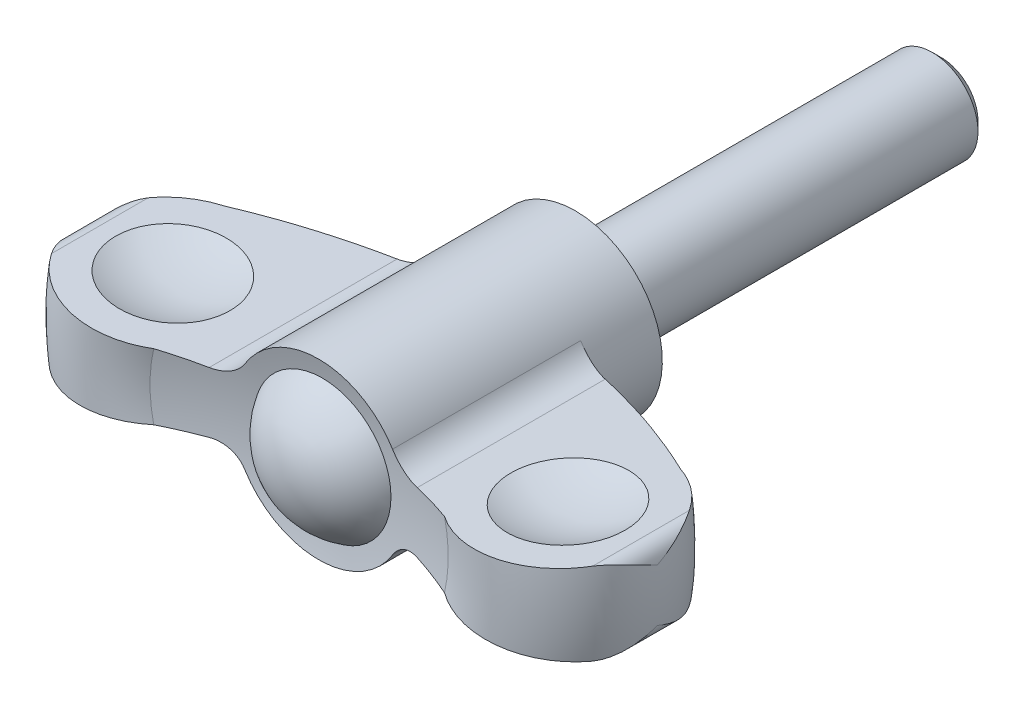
ISO-10303-21;
HEADER;
FILE_DESCRIPTION(('STEP AP214'),'2;1');
FILE_NAME('part.step','',(''),(''),'','','');
FILE_SCHEMA(('AUTOMOTIVE_DESIGN { 1 0 10303 214 1 1 1 1 }'));
ENDSEC;
DATA;
#1=APPLICATION_CONTEXT('core data for automotive mechanical design processes');
#2=APPLICATION_PROTOCOL_DEFINITION('international standard','automotive_design',2000,#1);
#3=PRODUCT_CONTEXT('',#1,'mechanical');
#4=PRODUCT('Part','Part','',(#3));
#5=PRODUCT_RELATED_PRODUCT_CATEGORY('part','',(#4));
#6=PRODUCT_DEFINITION_FORMATION('','',#4);
#7=PRODUCT_DEFINITION_CONTEXT('part definition',#1,'design');
#8=PRODUCT_DEFINITION('design','',#6,#7);
#9=PRODUCT_DEFINITION_SHAPE('','',#8);
#10=(LENGTH_UNIT() NAMED_UNIT(*) SI_UNIT(.MILLI.,.METRE.));
#11=(NAMED_UNIT(*) PLANE_ANGLE_UNIT() SI_UNIT($,.RADIAN.));
#12=(NAMED_UNIT(*) SI_UNIT($,.STERADIAN.) SOLID_ANGLE_UNIT());
#13=UNCERTAINTY_MEASURE_WITH_UNIT(LENGTH_MEASURE(1.E-05),#10,'distance_accuracy_value','');
#14=(GEOMETRIC_REPRESENTATION_CONTEXT(3) GLOBAL_UNCERTAINTY_ASSIGNED_CONTEXT((#13)) GLOBAL_UNIT_ASSIGNED_CONTEXT((#10,
#11,#12)) REPRESENTATION_CONTEXT('',''));
#15=CARTESIAN_POINT('',(0.,0.,0.));
#16=DIRECTION('',(0.,0.,1.));
#17=DIRECTION('',(1.,0.,0.));
#18=AXIS2_PLACEMENT_3D('',#15,#16,#17);
#19=CARTESIAN_POINT('',(0.,0.,76.6132216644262));
#20=DIRECTION('',(0.,0.,1.));
#21=DIRECTION('',(0.,1.,0.));
#22=AXIS2_PLACEMENT_3D('',#19,#20,#21);
#23=DEGENERATE_TOROIDAL_SURFACE('',#22,7.41274216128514,71.1525000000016,.F.);
#24=CARTESIAN_POINT('',(0.,0.,7.5));
#25=DIRECTION('',(0.,0.,1.));
#26=DIRECTION('',(0.,1.,0.));
#27=AXIS2_PLACEMENT_3D('',#24,#25,#26);
#28=CIRCLE('',#27,9.5);
#29=CARTESIAN_POINT('',(8.07537706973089,-5.00382705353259,7.5));
#30=VERTEX_POINT('',#29);
#31=CARTESIAN_POINT('',(8.07537711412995,5.0038269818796,7.5));
#32=VERTEX_POINT('',#31);
#33=EDGE_CURVE('E157',#30,#32,#28,.T.);
#34=ORIENTED_EDGE('',*,*,#33,.T.);
#35=CARTESIAN_POINT('',(8.07525319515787,5.00402698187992,7.50000000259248));
#36=CARTESIAN_POINT('',(8.12665454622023,4.92103773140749,7.49999174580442));
#37=CARTESIAN_POINT('',(8.18144861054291,4.84015820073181,7.50133541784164));
#38=CARTESIAN_POINT('',(8.29736182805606,4.68318005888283,7.50668034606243));
#39=CARTESIAN_POINT('',(8.35847989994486,4.607080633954,7.51068114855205));
#40=CARTESIAN_POINT('',(8.48644181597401,4.46037528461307,7.52128110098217));
#41=CARTESIAN_POINT('',(8.55327127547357,4.38975636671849,7.52787386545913));
#42=CARTESIAN_POINT('',(8.69224302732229,4.25429556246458,7.54356393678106));
#43=CARTESIAN_POINT('',(8.76438537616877,4.18945373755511,7.55266127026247));
#44=CARTESIAN_POINT('',(8.98795756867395,4.00427129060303,7.58354719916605));
#45=CARTESIAN_POINT('',(9.14667405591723,3.89311211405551,7.60894168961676));
#46=CARTESIAN_POINT('',(9.4786404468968,3.69815734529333,7.66816076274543));
#47=CARTESIAN_POINT('',(9.65189888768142,3.61437796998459,7.70199032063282));
#48=CARTESIAN_POINT('',(10.0125625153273,3.47403571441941,7.77763329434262));
#49=CARTESIAN_POINT('',(10.2002114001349,3.41819606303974,7.8196232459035));
#50=CARTESIAN_POINT('',(10.5805892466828,3.33774343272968,7.90948197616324));
#51=CARTESIAN_POINT('',(10.7733131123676,3.31310026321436,7.95734502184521));
#52=CARTESIAN_POINT('',(11.033653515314,3.30081513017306,8.02491673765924));
#53=CARTESIAN_POINT('',(11.1013248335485,3.29954054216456,8.04274730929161));
#54=CARTESIAN_POINT('',(11.236373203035,3.30079631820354,8.07885369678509));
#55=CARTESIAN_POINT('',(11.3037505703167,3.30331932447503,8.09712858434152));
#56=CARTESIAN_POINT('',(11.3709729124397,3.30772213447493,8.11561851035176));
#57=B_SPLINE_CURVE_WITH_KNOTS('',3,(#35,#36,#37,#38,#39,#40,#41,#42,#43,#44,#45,#46,#47,#48,#49,
#50,#51,#52,#53,#54,#55,#56),.UNSPECIFIED.,.F.,.F.,(4,2,2,2,2,2,2,2,2,2,4),(0.,
0.292752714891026,0.585455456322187,0.87744157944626,1.16943080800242,1.75277206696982,
2.33645821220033,2.93455895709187,3.53208044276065,3.74198071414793,3.95147483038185),.UNSPECIFIED.);
#58=CARTESIAN_POINT('',(11.3707729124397,3.30770903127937,8.11556349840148));
#59=VERTEX_POINT('',#58);
#60=EDGE_CURVE('E251',#32,#59,#57,.T.);
#61=ORIENTED_EDGE('',*,*,#60,.T.);
#62=CARTESIAN_POINT('',(24.9191403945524,4.19496480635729,13.4109144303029));
#63=CARTESIAN_POINT('',(23.8381391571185,4.12417217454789,12.8535823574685));
#64=CARTESIAN_POINT('',(22.7428134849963,4.05244146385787,12.324205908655));
#65=CARTESIAN_POINT('',(20.5293345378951,3.90748510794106,11.3241128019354));
#66=CARTESIAN_POINT('',(19.4112500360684,3.83426396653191,10.8532432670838));
#67=CARTESIAN_POINT('',(17.1522467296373,3.68632631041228,9.96991193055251));
#68=CARTESIAN_POINT('',(16.0113274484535,3.61160976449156,9.55745134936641));
#69=CARTESIAN_POINT('',(14.2836536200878,3.49846782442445,8.98318373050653));
#70=CARTESIAN_POINT('',(13.7042390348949,3.46052310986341,8.79894257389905));
#71=CARTESIAN_POINT('',(12.5407906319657,3.38433117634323,8.44572577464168));
#72=CARTESIAN_POINT('',(11.956756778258,3.34608395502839,8.27675025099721));
#73=CARTESIAN_POINT('',(11.3705729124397,3.30769593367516,8.11550848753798));
#74=B_SPLINE_CURVE_WITH_KNOTS('',3,(#62,#63,#64,#65,#66,#67,#68,#69,#70,#71,#72,#73),
.UNSPECIFIED.,.F.,.F.,(4,2,2,2,2,4),(0.,3.65437061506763,7.29898215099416,10.9436698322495,
12.771042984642,14.5984303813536),.UNSPECIFIED.);
#75=CARTESIAN_POINT('',(24.9187524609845,4.19493940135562,13.4107144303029));
#76=VERTEX_POINT('',#75);
#77=EDGE_CURVE('E242',#76,#59,#74,.T.);
#78=ORIENTED_EDGE('',*,*,#77,.F.);
#79=CARTESIAN_POINT('',(0.,0.,13.4107144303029));
#80=DIRECTION('',(0.,0.,1.));
#81=DIRECTION('',(0.,1.,0.));
#82=AXIS2_PLACEMENT_3D('',#79,#80,#81);
#83=CIRCLE('',#82,25.2693834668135);
#84=CARTESIAN_POINT('',(24.9187524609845,-4.19493940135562,13.4107144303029));
#85=VERTEX_POINT('',#84);
#86=EDGE_CURVE('E402',#85,#76,#83,.T.);
#87=ORIENTED_EDGE('',*,*,#86,.F.);
#88=CARTESIAN_POINT('',(11.3705729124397,-3.30769593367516,8.11550848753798));
#89=CARTESIAN_POINT('',(13.3194357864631,-3.43532310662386,8.65165350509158));
#90=CARTESIAN_POINT('',(15.2454387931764,-3.56145323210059,9.27335320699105));
#91=CARTESIAN_POINT('',(19.0285581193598,-3.80920223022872,10.6774595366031));
#92=CARTESIAN_POINT('',(20.8859409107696,-3.93083855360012,11.4591449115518));
#93=CARTESIAN_POINT('',(23.0778618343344,-4.07438311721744,12.4939591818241));
#94=CARTESIAN_POINT('',(23.4481408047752,-4.09863195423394,12.6727423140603));
#95=CARTESIAN_POINT('',(24.1858660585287,-4.14694412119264,13.0369148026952));
#96=CARTESIAN_POINT('',(24.5533094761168,-4.1710072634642,13.2223099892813));
#97=CARTESIAN_POINT('',(24.9191403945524,-4.19496480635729,13.4109144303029));
#98=B_SPLINE_CURVE_WITH_KNOTS('',3,(#88,#89,#90,#91,#92,#93,#94,#95,#96,#97),.UNSPECIFIED.,.F.,
.F.,(4,2,2,2,4),(0.,6.07517314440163,12.1235385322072,13.3591937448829,14.5959668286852),.UNSPECIFIED.);
#99=CARTESIAN_POINT('',(11.3707729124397,-3.30770903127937,8.11556349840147));
#100=VERTEX_POINT('',#99);
#101=EDGE_CURVE('E232',#100,#85,#98,.T.);
#102=ORIENTED_EDGE('',*,*,#101,.F.);
#103=CARTESIAN_POINT('',(11.3709729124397,-3.30772213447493,8.11561851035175));
#104=CARTESIAN_POINT('',(11.2701325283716,-3.30110509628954,8.08788118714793));
#105=CARTESIAN_POINT('',(11.1688817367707,-3.29874082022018,8.06061250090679));
#106=CARTESIAN_POINT('',(10.9662236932,-3.3025707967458,8.00721735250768));
#107=CARTESIAN_POINT('',(10.86481641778,-3.30876648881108,7.98109108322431));
#108=CARTESIAN_POINT('',(10.6624409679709,-3.32978238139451,7.93016922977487));
#109=CARTESIAN_POINT('',(10.5614733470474,-3.34461137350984,7.90537503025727));
#110=CARTESIAN_POINT('',(10.3608328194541,-3.38287019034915,7.85737208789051));
#111=CARTESIAN_POINT('',(10.2611598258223,-3.40629943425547,7.83416323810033));
#112=CARTESIAN_POINT('',(9.96486870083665,-3.48949811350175,7.76717843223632));
#113=CARTESIAN_POINT('',(9.77109378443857,-3.56216663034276,7.72607333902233));
#114=CARTESIAN_POINT('',(9.39755022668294,-3.74054378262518,7.65286990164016));
#115=CARTESIAN_POINT('',(9.21777675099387,-3.84624095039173,7.62076843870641));
#116=CARTESIAN_POINT('',(8.96611052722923,-4.02532517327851,7.58103605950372));
#117=CARTESIAN_POINT('',(8.88646307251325,-4.08719630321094,7.56933067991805));
#118=CARTESIAN_POINT('',(8.73245596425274,-4.21758210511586,7.54853793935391));
#119=CARTESIAN_POINT('',(8.65809406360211,-4.28609392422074,7.53944946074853));
#120=CARTESIAN_POINT('',(8.51538277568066,-4.42916784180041,7.52402786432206));
#121=CARTESIAN_POINT('',(8.44702397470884,-4.50372010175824,7.51769036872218));
#122=CARTESIAN_POINT('',(8.31677244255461,-4.65839173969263,7.50784180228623));
#123=CARTESIAN_POINT('',(8.25487550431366,-4.73850743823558,7.50432888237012));
#124=CARTESIAN_POINT('',(8.1753277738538,-4.85096452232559,7.50150027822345));
#125=CARTESIAN_POINT('',(8.15464683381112,-4.88116885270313,7.50093670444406));
#126=CARTESIAN_POINT('',(8.11423881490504,-4.94215928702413,7.50018643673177));
#127=CARTESIAN_POINT('',(8.09451057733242,-4.97294461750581,7.49999927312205));
#128=CARTESIAN_POINT('',(8.07525315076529,-5.00402705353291,7.50000000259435));
#129=B_SPLINE_CURVE_WITH_KNOTS('',3,(#103,#104,#105,#106,#107,#108,#109,#110,#111,#112,#113,
#114,#115,#116,#117,#118,#119,#120,#121,#122,#123,#124,#125,#126,#127,#128),.UNSPECIFIED.,.F.,
.F.,(4,2,2,2,2,2,2,2,2,2,2,2,4),(0.,0.314298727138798,0.628650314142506,0.943322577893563,
1.25797359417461,1.88762970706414,2.51706744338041,2.82134305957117,3.12548853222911,
3.42914821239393,3.73260894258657,3.8424257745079,3.95210549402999),.UNSPECIFIED.);
#130=EDGE_CURVE('E222',#100,#30,#129,.T.);
#131=ORIENTED_EDGE('',*,*,#130,.T.);
#132=EDGE_LOOP('',(#34,#61,#78,#87,#102,#131));
#133=FACE_BOUND('',#132,.T.);
#134=ADVANCED_FACE('F14',(#133),#23,.F.);
#135=CARTESIAN_POINT('',(0.,0.,22.4));
#136=DIRECTION('',(0.,0.,1.));
#137=DIRECTION('',(0.,1.,0.));
#138=AXIS2_PLACEMENT_3D('',#135,#136,#137);
#139=TOROIDAL_SURFACE('',#138,21.9,9.6);
#140=CARTESIAN_POINT('',(-18.1474454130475,-3.75149990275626,13.4105144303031));
#141=CARTESIAN_POINT('',(-17.8905850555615,-3.73467862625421,13.5060281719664));
#142=CARTESIAN_POINT('',(-17.6377608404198,-3.71812166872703,13.6124268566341));
#143=CARTESIAN_POINT('',(-17.1419285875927,-3.68565059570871,13.8461211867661));
#144=CARTESIAN_POINT('',(-16.8989202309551,-3.66973645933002,13.9734161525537));
#145=CARTESIAN_POINT('',(-16.4245099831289,-3.63866827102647,14.2479997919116));
#146=CARTESIAN_POINT('',(-16.1931050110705,-3.62351401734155,14.3952831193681));
#147=CARTESIAN_POINT('',(-15.743480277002,-3.59406898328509,14.7088327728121));
#148=CARTESIAN_POINT('',(-15.5252603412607,-3.57977819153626,14.8750988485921));
#149=CARTESIAN_POINT('',(-15.1034606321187,-3.55215536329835,15.2255617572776));
#150=CARTESIAN_POINT('',(-14.8998888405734,-3.53882384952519,15.4097682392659));
#151=CARTESIAN_POINT('',(-14.5090032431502,-3.51322552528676,15.794766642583));
#152=CARTESIAN_POINT('',(-14.321689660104,-3.50095872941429,15.9955587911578));
#153=CARTESIAN_POINT('',(-13.9647725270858,-3.4775849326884,16.4122828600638));
#154=CARTESIAN_POINT('',(-13.7951642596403,-3.46647762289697,16.6282107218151));
#155=CARTESIAN_POINT('',(-13.4749045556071,-3.44550444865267,17.073751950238));
#156=CARTESIAN_POINT('',(-13.3242529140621,-3.43563857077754,17.3033651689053));
#157=CARTESIAN_POINT('',(-13.0439598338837,-3.41728273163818,17.7732237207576));
#158=CARTESIAN_POINT('',(-12.9141954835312,-3.40878472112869,18.0133954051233));
#159=CARTESIAN_POINT('',(-12.6756273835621,-3.39316136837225,18.5039680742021));
#160=CARTESIAN_POINT('',(-12.5668227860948,-3.38603597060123,18.7543686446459));
#161=CARTESIAN_POINT('',(-12.3710778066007,-3.37321701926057,19.2636307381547));
#162=CARTESIAN_POINT('',(-12.2841387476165,-3.36752355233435,19.5224927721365));
#163=CARTESIAN_POINT('',(-12.1328924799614,-3.35761873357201,20.0467739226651));
#164=CARTESIAN_POINT('',(-12.0685848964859,-3.35340735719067,20.3121929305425));
#165=CARTESIAN_POINT('',(-11.9641647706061,-3.34656908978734,20.842606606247));
#166=CARTESIAN_POINT('',(-11.9236219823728,-3.34391402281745,21.1075162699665));
#167=CARTESIAN_POINT('',(-11.8652424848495,-3.34009086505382,21.6398358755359));
#168=CARTESIAN_POINT('',(-11.8474054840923,-3.33892275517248,21.9072457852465));
#169=CARTESIAN_POINT('',(-11.8345982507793,-3.33808403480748,22.4425774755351));
#170=CARTESIAN_POINT('',(-11.8396248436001,-3.33841321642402,22.7104991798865));
#171=CARTESIAN_POINT('',(-11.8724923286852,-3.34056564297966,23.2449323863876));
#172=CARTESIAN_POINT('',(-11.9003331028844,-3.34238888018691,23.5114438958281));
#173=CARTESIAN_POINT('',(-11.9780680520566,-3.34747958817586,24.0376567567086));
#174=CARTESIAN_POINT('',(-12.027669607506,-3.35072789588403,24.2974015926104));
#175=CARTESIAN_POINT('',(-12.1484267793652,-3.35863604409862,24.811805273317));
#176=CARTESIAN_POINT('',(-12.2195821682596,-3.36329586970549,25.0664641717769));
#177=CARTESIAN_POINT('',(-12.3828443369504,-3.37398758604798,25.5689078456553));
#178=CARTESIAN_POINT('',(-12.4749485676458,-3.38001930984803,25.8166934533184));
#179=CARTESIAN_POINT('',(-12.679407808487,-3.39340894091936,26.3038316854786));
#180=CARTESIAN_POINT('',(-12.7917703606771,-3.40076734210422,26.543181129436));
#181=CARTESIAN_POINT('',(-13.0369078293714,-3.41682090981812,27.0137884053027));
#182=CARTESIAN_POINT('',(-13.1698514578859,-3.42552712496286,27.2449579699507));
#183=CARTESIAN_POINT('',(-13.4544154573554,-3.44416265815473,27.6954567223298));
#184=CARTESIAN_POINT('',(-13.6060365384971,-3.45409202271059,27.9147854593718));
#185=CARTESIAN_POINT('',(-13.9268367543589,-3.47510059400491,28.3401572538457));
#186=CARTESIAN_POINT('',(-14.0960166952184,-3.48617985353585,28.5461997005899));
#187=CARTESIAN_POINT('',(-14.4507138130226,-3.50940826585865,28.9436423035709));
#188=CARTESIAN_POINT('',(-14.6362312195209,-3.52155743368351,29.1350422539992));
#189=CARTESIAN_POINT('',(-15.0260268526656,-3.54708437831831,29.5054914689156));
#190=CARTESIAN_POINT('',(-15.2305978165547,-3.56048132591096,29.6842314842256));
#191=CARTESIAN_POINT('',(-15.6538967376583,-3.58820233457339,30.0239900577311));
#192=CARTESIAN_POINT('',(-15.8726245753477,-3.6025263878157,30.1850087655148));
#193=CARTESIAN_POINT('',(-16.322752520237,-3.63200437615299,30.4882695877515));
#194=CARTESIAN_POINT('',(-16.5541555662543,-3.6471585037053,30.6305073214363));
#195=CARTESIAN_POINT('',(-17.0278914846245,-3.67818253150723,30.8951425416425));
#196=CARTESIAN_POINT('',(-17.2702206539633,-3.69405218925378,31.017546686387));
#197=CARTESIAN_POINT('',(-17.7669669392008,-3.72658312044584,31.2429802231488));
#198=CARTESIAN_POINT('',(-18.0214889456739,-3.74325126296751,31.3457775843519));
#199=CARTESIAN_POINT('',(-18.538265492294,-3.77709393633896,31.5295393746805));
#200=CARTESIAN_POINT('',(-18.8005200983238,-3.79426847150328,31.6105036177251));
#201=CARTESIAN_POINT('',(-19.3309113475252,-3.82900274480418,31.7500060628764));
#202=CARTESIAN_POINT('',(-19.5990481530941,-3.84656249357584,31.8085436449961));
#203=CARTESIAN_POINT('',(-20.1392890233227,-3.88194179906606,31.9027453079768));
#204=CARTESIAN_POINT('',(-20.4113930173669,-3.89976135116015,31.9384097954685));
#205=CARTESIAN_POINT('',(-20.9576381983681,-3.93553386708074,31.9865808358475));
#206=CARTESIAN_POINT('',(-21.2317794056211,-3.95348683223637,31.9990871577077));
#207=CARTESIAN_POINT('',(-21.7801364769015,-3.98939765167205,32.0008164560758));
#208=CARTESIAN_POINT('',(-22.0543523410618,-4.00735550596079,31.9900393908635));
#209=CARTESIAN_POINT('',(-22.6008596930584,-4.04314519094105,31.9452447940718));
#210=CARTESIAN_POINT('',(-22.8731513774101,-4.06097703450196,31.9112296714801));
#211=CARTESIAN_POINT('',(-23.4138724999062,-4.09638779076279,31.8201695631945));
#212=CARTESIAN_POINT('',(-23.6823019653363,-4.1139667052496,31.7631247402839));
#213=CARTESIAN_POINT('',(-24.2118784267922,-4.14864761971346,31.6267614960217));
#214=CARTESIAN_POINT('',(-24.4730575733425,-4.16575172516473,31.547568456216));
#215=CARTESIAN_POINT('',(-24.987795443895,-4.19946088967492,31.3673123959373));
#216=CARTESIAN_POINT('',(-25.2413540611,-4.2160659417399,31.2662490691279));
#217=CARTESIAN_POINT('',(-25.7391278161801,-4.24866415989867,31.0428965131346));
#218=CARTESIAN_POINT('',(-25.9833385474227,-4.26465703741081,30.9205974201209));
#219=CARTESIAN_POINT('',(-26.4605066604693,-4.29590583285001,30.655664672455));
#220=CARTESIAN_POINT('',(-26.6934645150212,-4.31116178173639,30.5130318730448));
#221=CARTESIAN_POINT('',(-27.1452633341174,-4.34074919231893,30.2092249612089));
#222=CARTESIAN_POINT('',(-27.3641711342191,-4.35508503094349,30.0481506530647));
#223=CARTESIAN_POINT('',(-27.7875859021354,-4.38281362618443,29.7080080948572));
#224=CARTESIAN_POINT('',(-27.9920934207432,-4.39620641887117,29.5289405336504));
#225=CARTESIAN_POINT('',(-28.3848624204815,-4.42192808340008,29.1544313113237));
#226=CARTESIAN_POINT('',(-28.5731528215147,-4.43425884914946,28.9590200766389));
#227=CARTESIAN_POINT('',(-28.9324617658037,-4.45778928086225,28.5530043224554));
#228=CARTESIAN_POINT('',(-29.1034908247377,-4.4689896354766,28.3424091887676));
#229=CARTESIAN_POINT('',(-29.319374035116,-4.48312739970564,28.0522910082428));
#230=CARTESIAN_POINT('',(-29.3724491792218,-4.48660318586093,27.9788119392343));
#231=CARTESIAN_POINT('',(-29.4764415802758,-4.49341344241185,27.8304567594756));
#232=CARTESIAN_POINT('',(-29.5273611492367,-4.49674806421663,27.7555822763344));
#233=CARTESIAN_POINT('',(-29.5772181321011,-4.50001309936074,27.679991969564));
#234=B_SPLINE_CURVE_WITH_KNOTS('',3,(#140,#141,#142,#143,#144,#145,#146,#147,#148,#149,#150,
#151,#152,#153,#154,#155,#156,#157,#158,#159,#160,#161,#162,#163,#164,#165,#166,#167,#168,#169,
#170,#171,#172,#173,#174,#175,#176,#177,#178,#179,#180,#181,#182,#183,#184,#185,#186,#187,#188,
#189,#190,#191,#192,#193,#194,#195,#196,#197,#198,#199,#200,#201,#202,#203,#204,#205,#206,#207,
#208,#209,#210,#211,#212,#213,#214,#215,#216,#217,#218,#219,#220,#221,#222,#223,#224,#225,#226,
#227,#228,#229,#230,#231,#232,#233),.UNSPECIFIED.,.F.,.F.,(4,2,2,2,2,2,2,2,2,2,2,2,2,2,2,2,2,2,
2,2,2,2,2,2,2,2,2,2,2,2,2,2,2,2,2,2,2,2,2,2,2,2,2,2,2,2,4),(0.,0.82342903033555,
1.64683128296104,2.47001373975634,3.29318534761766,4.11680216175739,4.9404302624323,
5.76383834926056,6.58723753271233,7.40559872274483,8.22392680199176,9.04230438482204,
9.86066841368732,10.6637182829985,11.4667578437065,12.2696859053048,13.0726098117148,
13.8650526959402,14.6574872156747,15.449825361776,16.2424591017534,17.0419728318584,
17.8415169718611,18.6410978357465,19.4406899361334,20.2556974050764,21.0706979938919,
21.8858883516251,22.7008044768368,23.5248358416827,24.3488742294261,25.1729353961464,
25.9969819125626,26.8210366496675,27.6450928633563,28.469063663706,29.2930286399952,
30.1124203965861,30.9318236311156,31.7516084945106,32.5713588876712,33.3868657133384,
34.2023413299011,35.0163312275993,35.8298222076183,36.1019244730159,36.3737270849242),.UNSPECIFIED.);
#235=CARTESIAN_POINT('',(-15.8916566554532,-3.60377276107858,30.1939503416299));
#236=VERTEX_POINT('',#235);
#237=CARTESIAN_POINT('',(-29.5770181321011,-4.5,27.6802951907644));
#238=VERTEX_POINT('',#237);
#239=EDGE_CURVE('E276',#236,#238,#234,.T.);
#240=ORIENTED_EDGE('',*,*,#239,.F.);
#241=CARTESIAN_POINT('',(0.,0.,30.1939503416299));
#242=DIRECTION('',(0.,0.,1.));
#243=DIRECTION('',(0.,1.,0.));
#244=AXIS2_PLACEMENT_3D('',#241,#242,#243);
#245=CIRCLE('',#244,16.2951504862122);
#246=CARTESIAN_POINT('',(-15.8916566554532,3.60377276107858,30.1939503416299));
#247=VERTEX_POINT('',#246);
#248=EDGE_CURVE('E210',#247,#236,#245,.T.);
#249=ORIENTED_EDGE('',*,*,#248,.F.);
#250=CARTESIAN_POINT('',(-29.577218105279,4.50001309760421,27.6799920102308));
#251=CARTESIAN_POINT('',(-29.4283813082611,4.49026607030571,27.9057071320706));
#252=CARTESIAN_POINT('',(-29.2699701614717,4.47989203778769,28.1250732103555));
#253=CARTESIAN_POINT('',(-28.9352574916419,4.45797236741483,28.5496181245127));
#254=CARTESIAN_POINT('',(-28.7589571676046,4.44642680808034,28.7547979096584));
#255=CARTESIAN_POINT('',(-28.3898682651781,4.42225590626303,29.1493363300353));
#256=CARTESIAN_POINT('',(-28.1970944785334,4.40963153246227,29.3387088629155));
#257=CARTESIAN_POINT('',(-27.7963194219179,4.38338556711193,29.7005094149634));
#258=CARTESIAN_POINT('',(-27.5883182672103,4.3697639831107,29.872937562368));
#259=CARTESIAN_POINT('',(-27.1584989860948,4.34161596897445,30.199703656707));
#260=CARTESIAN_POINT('',(-26.9366758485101,4.32708921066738,30.3540349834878));
#261=CARTESIAN_POINT('',(-26.4808650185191,4.29723906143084,30.6434656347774));
#262=CARTESIAN_POINT('',(-26.2468771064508,4.28191565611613,30.7785646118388));
#263=CARTESIAN_POINT('',(-25.7684462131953,4.25058416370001,31.0285776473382));
#264=CARTESIAN_POINT('',(-25.5240048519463,4.23457618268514,31.1434948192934));
#265=CARTESIAN_POINT('',(-25.0263706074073,4.20198710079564,31.3523874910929));
#266=CARTESIAN_POINT('',(-24.773177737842,4.1854060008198,31.4463630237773));
#267=CARTESIAN_POINT('',(-24.2590478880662,4.15173665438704,31.6129966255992));
#268=CARTESIAN_POINT('',(-23.9980896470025,4.13464701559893,31.685588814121));
#269=CARTESIAN_POINT('',(-23.4709078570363,4.10012292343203,31.8086173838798));
#270=CARTESIAN_POINT('',(-23.2046821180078,4.08268832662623,31.8590443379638));
#271=CARTESIAN_POINT('',(-22.6689091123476,4.04760161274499,31.9373839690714));
#272=CARTESIAN_POINT('',(-22.3993613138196,4.0299494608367,31.9652929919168));
#273=CARTESIAN_POINT('',(-21.8589964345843,3.99456203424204,31.9984159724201));
#274=CARTESIAN_POINT('',(-21.5881799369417,3.97682679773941,32.0036394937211));
#275=CARTESIAN_POINT('',(-21.0454404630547,3.94128386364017,31.9913795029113));
#276=CARTESIAN_POINT('',(-20.7735205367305,3.9234763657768,31.9737602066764));
#277=CARTESIAN_POINT('',(-20.2321124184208,3.88802061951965,31.9157373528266));
#278=CARTESIAN_POINT('',(-19.9626242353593,3.8703723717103,31.8753337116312));
#279=CARTESIAN_POINT('',(-19.4280257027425,3.83536257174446,31.7720671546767));
#280=CARTESIAN_POINT('',(-19.1629144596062,3.81800096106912,31.7092088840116));
#281=CARTESIAN_POINT('',(-18.6387730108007,3.78367597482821,31.5614710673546));
#282=CARTESIAN_POINT('',(-18.3797450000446,3.76671274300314,31.4765837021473));
#283=CARTESIAN_POINT('',(-17.8682212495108,3.73321406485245,31.2848646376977));
#284=CARTESIAN_POINT('',(-17.6157711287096,3.71668160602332,31.177910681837));
#285=CARTESIAN_POINT('',(-17.1207307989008,3.6842623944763,30.9431230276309));
#286=CARTESIAN_POINT('',(-16.8781406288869,3.66837564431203,30.8152892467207));
#287=CARTESIAN_POINT('',(-16.4045275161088,3.63735965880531,30.5396362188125));
#288=CARTESIAN_POINT('',(-16.1735051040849,3.62223045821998,30.3918160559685));
#289=CARTESIAN_POINT('',(-15.7246794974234,3.59283775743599,30.0772205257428));
#290=CARTESIAN_POINT('',(-15.5068766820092,3.57857428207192,29.9104446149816));
#291=CARTESIAN_POINT('',(-15.0856203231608,3.55098703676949,29.5587225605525));
#292=CARTESIAN_POINT('',(-14.8821981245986,3.53766531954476,29.3737387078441));
#293=CARTESIAN_POINT('',(-14.4917116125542,3.51209313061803,28.9871837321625));
#294=CARTESIAN_POINT('',(-14.3046468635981,3.49984263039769,28.7856130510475));
#295=CARTESIAN_POINT('',(-13.9482722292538,3.47650436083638,28.3672761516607));
#296=CARTESIAN_POINT('',(-13.7789624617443,3.46541659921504,28.1505098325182));
#297=CARTESIAN_POINT('',(-13.4594078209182,3.4444895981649,27.7032976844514));
#298=CARTESIAN_POINT('',(-13.3091625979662,3.43465033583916,27.4728521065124));
#299=CARTESIAN_POINT('',(-13.0300075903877,3.4163690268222,27.0017206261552));
#300=CARTESIAN_POINT('',(-12.9009427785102,3.40791682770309,26.7611269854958));
#301=CARTESIAN_POINT('',(-12.6638563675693,3.39239050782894,26.269856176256));
#302=CARTESIAN_POINT('',(-12.5558264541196,3.38531584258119,26.0191830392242));
#303=CARTESIAN_POINT('',(-12.3616487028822,3.37259952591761,25.5094385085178));
#304=CARTESIAN_POINT('',(-12.2755026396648,3.36695799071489,25.2503664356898));
#305=CARTESIAN_POINT('',(-12.125856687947,3.35715797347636,24.7257346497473));
#306=CARTESIAN_POINT('',(-12.0623564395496,3.35299946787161,24.4601750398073));
#307=CARTESIAN_POINT('',(-11.9595441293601,3.34626649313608,23.9295575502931));
#308=CARTESIAN_POINT('',(-11.9198013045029,3.34366381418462,23.6645834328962));
#309=CARTESIAN_POINT('',(-11.8630211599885,3.33994539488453,23.1322038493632));
#310=CARTESIAN_POINT('',(-11.8459835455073,3.33882963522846,22.8647984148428));
#311=CARTESIAN_POINT('',(-11.8347668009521,3.33809507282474,22.3295252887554));
#312=CARTESIAN_POINT('',(-11.8405860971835,3.33847616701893,22.0616576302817));
#313=CARTESIAN_POINT('',(-11.8750272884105,3.34073165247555,21.5273997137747));
#314=CARTESIAN_POINT('',(-11.9036490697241,3.34260603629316,21.2610094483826));
#315=CARTESIAN_POINT('',(-11.9829240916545,3.34779760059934,20.7350583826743));
#316=CARTESIAN_POINT('',(-12.033288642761,3.35109587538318,20.4754538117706));
#317=CARTESIAN_POINT('',(-12.1555550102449,3.35910285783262,19.961393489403));
#318=CARTESIAN_POINT('',(-12.2274566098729,3.36381155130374,19.7069376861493));
#319=CARTESIAN_POINT('',(-12.3921774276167,3.37459879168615,19.2049950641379));
#320=CARTESIAN_POINT('',(-12.4849912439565,3.38067698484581,18.9575064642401));
#321=CARTESIAN_POINT('',(-12.6908448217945,3.39415792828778,18.470999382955));
#322=CARTESIAN_POINT('',(-12.8038936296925,3.40156127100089,18.2319847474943));
#323=CARTESIAN_POINT('',(-13.050399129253,3.41770442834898,17.7620583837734));
#324=CARTESIAN_POINT('',(-13.1840279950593,3.42645551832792,17.5312373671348));
#325=CARTESIAN_POINT('',(-13.4698675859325,3.4451745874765,17.0815911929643));
#326=CARTESIAN_POINT('',(-13.6220707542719,3.45514207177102,16.8627612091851));
#327=CARTESIAN_POINT('',(-13.9440945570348,3.4762307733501,16.4382825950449));
#328=CARTESIAN_POINT('',(-14.113927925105,3.48735282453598,16.2326436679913));
#329=CARTESIAN_POINT('',(-14.4698944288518,3.51066436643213,15.836072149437));
#330=CARTESIAN_POINT('',(-14.6560271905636,3.52285383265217,15.6451392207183));
#331=CARTESIAN_POINT('',(-15.0471805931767,3.54846969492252,15.2755429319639));
#332=CARTESIAN_POINT('',(-15.2525053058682,3.56191600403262,15.097202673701));
#333=CARTESIAN_POINT('',(-15.6772923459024,3.58973446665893,14.7583242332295));
#334=CARTESIAN_POINT('',(-15.8967545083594,3.60410660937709,14.5977858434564));
#335=CARTESIAN_POINT('',(-16.3478939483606,3.63365083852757,14.2958496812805));
#336=CARTESIAN_POINT('',(-16.5795509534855,3.64882159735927,14.1544214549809));
#337=CARTESIAN_POINT('',(-17.0537037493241,3.67987292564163,13.8914238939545));
#338=CARTESIAN_POINT('',(-17.2961933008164,3.69575308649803,13.769843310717));
#339=CARTESIAN_POINT('',(-17.6425873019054,3.71843774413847,13.6138611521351));
#340=CARTESIAN_POINT('',(-17.7426773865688,3.7249924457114,13.5707938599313));
#341=CARTESIAN_POINT('',(-17.9441132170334,3.7381840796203,13.4880908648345));
#342=CARTESIAN_POINT('',(-18.045457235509,3.74482089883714,13.4484509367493));
#343=CARTESIAN_POINT('',(-18.1474454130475,3.75149990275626,13.4105144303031));
#344=B_SPLINE_CURVE_WITH_KNOTS('',3,(#250,#251,#252,#253,#254,#255,#256,#257,#258,#259,#260,
#261,#262,#263,#264,#265,#266,#267,#268,#269,#270,#271,#272,#273,#274,#275,#276,#277,#278,#279,
#280,#281,#282,#283,#284,#285,#286,#287,#288,#289,#290,#291,#292,#293,#294,#295,#296,#297,#298,
#299,#300,#301,#302,#303,#304,#305,#306,#307,#308,#309,#310,#311,#312,#313,#314,#315,#316,#317,
#318,#319,#320,#321,#322,#323,#324,#325,#326,#327,#328,#329,#330,#331,#332,#333,#334,#335,#336,
#337,#338,#339,#340,#341,#342,#343),.UNSPECIFIED.,.F.,.F.,(4,2,2,2,2,2,2,2,2,2,2,2,2,2,2,2,2,2,
2,2,2,2,2,2,2,2,2,2,2,2,2,2,2,2,2,2,2,2,2,2,2,2,2,2,2,2,4),(0.,0.811383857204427,
1.62271336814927,2.43332187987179,3.24392425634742,4.05482224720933,4.86573488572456,
5.67652231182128,6.48730846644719,7.30056707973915,8.11417124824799,8.92790742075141,
9.7413005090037,10.5595508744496,11.3778042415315,12.1958884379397,13.0142634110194,
13.8373004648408,14.6603407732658,15.4834188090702,16.3065204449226,17.1313641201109,
17.9561858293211,18.7810130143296,19.6058250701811,20.4243011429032,21.2424530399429,
22.0606712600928,22.8788764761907,23.6817568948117,24.4846268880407,25.2874416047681,
26.0902523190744,26.8827166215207,27.6751729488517,28.4674248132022,29.2600317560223,
30.0596712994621,30.8589865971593,31.658883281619,32.4587616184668,33.2746912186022,
34.090611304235,34.9052154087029,35.7193562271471,36.0467859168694,36.3738060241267),.UNSPECIFIED.);
#345=CARTESIAN_POINT('',(-29.577018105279,4.5,27.6802952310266));
#346=VERTEX_POINT('',#345);
#347=EDGE_CURVE('E298',#346,#247,#344,.T.);
#348=ORIENTED_EDGE('',*,*,#347,.F.);
#349=CARTESIAN_POINT('',(-31.369564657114,2.86363636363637,22.4));
#350=CARTESIAN_POINT('',(-31.3693228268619,2.86628559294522,22.4059654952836));
#351=CARTESIAN_POINT('',(-31.3690751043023,2.86893438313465,22.4119311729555));
#352=CARTESIAN_POINT('',(-31.3455550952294,3.11453943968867,22.9652019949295));
#353=CARTESIAN_POINT('',(-31.2727100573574,3.35362322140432,23.5139845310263));
#354=CARTESIAN_POINT('',(-31.0906514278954,3.68216340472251,24.3317563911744));
#355=CARTESIAN_POINT('',(-31.0177760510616,3.78670945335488,24.6035877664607));
#356=CARTESIAN_POINT('',(-30.8477677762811,3.98135441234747,25.1449637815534));
#357=CARTESIAN_POINT('',(-30.7506472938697,4.07146067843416,25.4145095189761));
#358=CARTESIAN_POINT('',(-30.5719332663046,4.20252900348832,25.8529322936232));
#359=CARTESIAN_POINT('',(-30.4974342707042,4.24947683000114,26.0229493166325));
#360=CARTESIAN_POINT('',(-30.3388744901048,4.33328283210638,26.3608778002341));
#361=CARTESIAN_POINT('',(-30.2548212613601,4.37014890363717,26.5287908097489));
#362=CARTESIAN_POINT('',(-30.0769796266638,4.43174329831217,26.8627513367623));
#363=CARTESIAN_POINT('',(-29.9831491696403,4.45641633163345,27.0287870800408));
#364=CARTESIAN_POINT('',(-29.8357178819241,4.48201227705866,27.2752518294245));
#365=CARTESIAN_POINT('',(-29.7853951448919,4.48864307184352,27.3570723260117));
#366=CARTESIAN_POINT('',(-29.6826484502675,4.4976362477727,27.5196657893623));
#367=CARTESIAN_POINT('',(-29.630223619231,4.49999683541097,27.6004383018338));
#368=CARTESIAN_POINT('',(-29.5768181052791,4.4999999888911,27.6805954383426));
#369=B_SPLINE_CURVE_WITH_KNOTS('',3,(#349,#350,#351,#352,#353,#354,#355,#356,#357,#358,#359,
#360,#361,#362,#363,#364,#365,#366,#367,#368),.UNSPECIFIED.,.F.,.F.,(4,2,2,2,2,2,2,2,2,4),(0.,
0.0195959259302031,1.81731826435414,2.71712331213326,3.61646852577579,4.19044381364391,
4.76396827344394,5.34007007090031,5.62881792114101,5.91768701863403),.UNSPECIFIED.);
#370=CARTESIAN_POINT('',(-31.369564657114,2.86363636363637,22.4));
#371=VERTEX_POINT('',#370);
#372=EDGE_CURVE('E360',#371,#346,#369,.T.);
#373=ORIENTED_EDGE('',*,*,#372,.F.);
#374=CARTESIAN_POINT('',(-29.576818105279,4.49999998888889,17.1194045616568));
#375=CARTESIAN_POINT('',(-29.619139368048,4.50000102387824,17.1829266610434));
#376=CARTESIAN_POINT('',(-29.6608485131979,4.49851722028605,17.2468391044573));
#377=CARTESIAN_POINT('',(-29.7429683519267,4.49280699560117,17.3753522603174));
#378=CARTESIAN_POINT('',(-29.7833793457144,4.48858121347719,17.4399528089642));
#379=CARTESIAN_POINT('',(-29.9024609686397,4.47214705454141,17.6344933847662));
#380=CARTESIAN_POINT('',(-29.9791105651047,4.45618046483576,17.765367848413));
#381=CARTESIAN_POINT('',(-30.1263186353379,4.41582925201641,18.0284830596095));
#382=CARTESIAN_POINT('',(-30.1969002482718,4.39147855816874,18.1607162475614));
#383=CARTESIAN_POINT('',(-30.3321494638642,4.33558288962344,18.4267422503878));
#384=CARTESIAN_POINT('',(-30.3968138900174,4.30403408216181,18.5605358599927));
#385=CARTESIAN_POINT('',(-30.5626786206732,4.21088535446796,18.9222641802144));
#386=CARTESIAN_POINT('',(-30.6582400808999,4.1435864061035,19.1513508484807));
#387=CARTESIAN_POINT('',(-30.8316829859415,3.99568952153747,19.6118454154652));
#388=CARTESIAN_POINT('',(-30.9095558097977,3.91508513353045,19.8432543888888));
#389=CARTESIAN_POINT('',(-31.1166837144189,3.65806718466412,20.540705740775));
#390=CARTESIAN_POINT('',(-31.219251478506,3.46657224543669,21.009542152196));
#391=CARTESIAN_POINT('',(-31.3069727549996,3.20184757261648,21.6292554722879));
#392=CARTESIAN_POINT('',(-31.3245600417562,3.13661935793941,21.7798368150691));
#393=CARTESIAN_POINT('',(-31.3522803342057,3.00489991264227,22.080989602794));
#394=CARTESIAN_POINT('',(-31.3624220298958,2.93841024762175,22.2315608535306));
#395=CARTESIAN_POINT('',(-31.3690750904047,2.86893445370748,22.3880686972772));
#396=CARTESIAN_POINT('',(-31.3693228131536,2.86628566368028,22.3940343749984));
#397=CARTESIAN_POINT('',(-31.369564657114,2.86363636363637,22.4));
#398=B_SPLINE_CURVE_WITH_KNOTS('',3,(#374,#375,#376,#377,#378,#379,#380,#381,#382,#383,#384,
#385,#386,#387,#388,#389,#390,#391,#392,#393,#394,#395,#396,#397),.UNSPECIFIED.,.F.,.F.,(4,2,2,
2,2,2,2,2,2,2,2,4),(0.,0.228945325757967,0.457837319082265,0.914918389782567,1.37017104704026,
1.82566667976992,2.59598824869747,3.36668444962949,4.90952775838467,5.40460012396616,
5.89909375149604,5.91868967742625),.UNSPECIFIED.);
#399=CARTESIAN_POINT('',(-29.577018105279,4.5,17.1197047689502));
#400=VERTEX_POINT('',#399);
#401=EDGE_CURVE('E354',#400,#371,#398,.T.);
#402=ORIENTED_EDGE('',*,*,#401,.F.);
#403=CARTESIAN_POINT('',(-24.918217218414,4.19490434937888,13.4105144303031));
#404=CARTESIAN_POINT('',(-25.1747287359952,4.2117027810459,13.5063205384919));
#405=CARTESIAN_POINT('',(-25.4271515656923,4.22823345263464,13.6131252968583));
#406=CARTESIAN_POINT('',(-25.9220334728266,4.26064228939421,13.847863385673));
#407=CARTESIAN_POINT('',(-26.1644920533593,4.27652042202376,13.9757977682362));
#408=CARTESIAN_POINT('',(-26.6315223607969,4.30710531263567,14.2483504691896));
#409=CARTESIAN_POINT('',(-26.8563943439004,4.32183173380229,14.3924524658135));
#410=CARTESIAN_POINT('',(-27.2933789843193,4.35044899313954,14.6988790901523));
#411=CARTESIAN_POINT('',(-27.5054935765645,4.3643399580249,14.8612009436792));
#412=CARTESIAN_POINT('',(-27.888316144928,4.38941025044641,15.180307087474));
#413=CARTESIAN_POINT('',(-28.0607863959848,4.40070498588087,15.3349749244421));
#414=CARTESIAN_POINT('',(-28.3941147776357,4.4225340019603,15.6563910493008));
#415=CARTESIAN_POINT('',(-28.5549737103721,4.43306833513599,15.8231385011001));
#416=CARTESIAN_POINT('',(-28.8677866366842,4.45355383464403,16.1718241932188));
#417=CARTESIAN_POINT('',(-29.0194509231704,4.46348602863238,16.354023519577));
#418=CARTESIAN_POINT('',(-29.3089338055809,4.48244368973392,16.72919338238));
#419=CARTESIAN_POINT('',(-29.4467504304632,4.49146902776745,16.9221654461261));
#420=CARTESIAN_POINT('',(-29.577218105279,4.50001309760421,17.1200079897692));
#421=B_SPLINE_CURVE_WITH_KNOTS('',3,(#403,#404,#405,#406,#407,#408,#409,#410,#411,#412,#413,
#414,#415,#416,#417,#418,#419,#420),.UNSPECIFIED.,.F.,.F.,(4,2,2,2,2,2,2,2,4),(0.,
0.822759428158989,1.64555983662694,2.44710662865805,3.24853154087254,3.94375872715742,
4.63893783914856,5.35009750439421,6.06135825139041),.UNSPECIFIED.);
#422=CARTESIAN_POINT('',(-24.9187524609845,4.19493940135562,13.4107144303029));
#423=VERTEX_POINT('',#422);
#424=EDGE_CURVE('E277',#423,#400,#421,.T.);
#425=ORIENTED_EDGE('',*,*,#424,.F.);
#426=CARTESIAN_POINT('',(-24.9187524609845,-4.19493940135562,13.4107144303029));
#427=VERTEX_POINT('',#426);
#428=EDGE_CURVE('E399',#423,#427,#83,.T.);
#429=ORIENTED_EDGE('',*,*,#428,.T.);
#430=CARTESIAN_POINT('',(-29.5772181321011,-4.50001309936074,17.120008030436));
#431=CARTESIAN_POINT('',(-29.4265102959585,-4.49014354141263,16.8914517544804));
#432=CARTESIAN_POINT('',(-29.2659808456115,-4.4796307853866,16.6694035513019));
#433=CARTESIAN_POINT('',(-28.926581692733,-4.45740420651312,16.2398574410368));
#434=CARTESIAN_POINT('',(-28.7477118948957,-4.44569037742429,16.0323596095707));
#435=CARTESIAN_POINT('',(-28.3777669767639,-4.42146341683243,15.6385922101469));
#436=CARTESIAN_POINT('',(-28.1871253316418,-4.40897867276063,15.45191331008));
#437=CARTESIAN_POINT('',(-27.7910307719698,-4.38303922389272,15.0951091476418));
#438=CARTESIAN_POINT('',(-27.5855799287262,-4.36958465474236,14.9249815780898));
#439=CARTESIAN_POINT('',(-27.188874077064,-4.34360517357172,14.6233879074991));
#440=CARTESIAN_POINT('',(-26.9992422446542,-4.33118656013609,14.4897704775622));
#441=CARTESIAN_POINT('',(-26.6108443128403,-4.30575114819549,14.2366062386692));
#442=CARTESIAN_POINT('',(-26.4120783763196,-4.29273436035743,14.1170591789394));
#443=CARTESIAN_POINT('',(-26.0017910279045,-4.26586545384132,13.890069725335));
#444=CARTESIAN_POINT('',(-25.7900813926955,-4.25200100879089,13.7829689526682));
#445=CARTESIAN_POINT('',(-25.3593416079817,-4.22379271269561,13.5846713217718));
#446=CARTESIAN_POINT('',(-25.1403106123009,-4.20944880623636,13.4934763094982));
#447=CARTESIAN_POINT('',(-24.918217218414,-4.19490434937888,13.4105144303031));
#448=B_SPLINE_CURVE_WITH_KNOTS('',3,(#430,#431,#432,#433,#434,#435,#436,#437,#438,#439,#440,
#441,#442,#443,#444,#445,#446,#447),.UNSPECIFIED.,.F.,.F.,(4,2,2,2,2,2,2,2,4),(0.,
0.821594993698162,1.64319425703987,2.44361485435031,3.24392371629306,3.94026356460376,
4.63659100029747,5.34893291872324,6.06135745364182),.UNSPECIFIED.);
#449=CARTESIAN_POINT('',(-29.5770181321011,-4.5,17.1197048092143));
#450=VERTEX_POINT('',#449);
#451=EDGE_CURVE('E530',#450,#427,#448,.T.);
#452=ORIENTED_EDGE('',*,*,#451,.F.);
#453=CARTESIAN_POINT('',(-31.369564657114,-2.86363636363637,22.4));
#454=CARTESIAN_POINT('',(-31.3693228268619,-2.86628559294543,22.3940345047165));
#455=CARTESIAN_POINT('',(-31.3690751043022,-2.86893438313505,22.3880688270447));
#456=CARTESIAN_POINT('',(-31.3455550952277,-3.11453943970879,21.8347980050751));
#457=CARTESIAN_POINT('',(-31.272710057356,-3.35362322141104,21.2860154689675));
#458=CARTESIAN_POINT('',(-31.0906514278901,-3.68216340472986,20.468243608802));
#459=CARTESIAN_POINT('',(-31.0177760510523,-3.78670945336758,20.1964122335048));
#460=CARTESIAN_POINT('',(-30.8477677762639,-3.98135441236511,19.6550362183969));
#461=CARTESIAN_POINT('',(-30.7506472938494,-4.07146067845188,19.3854904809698));
#462=CARTESIAN_POINT('',(-30.5719332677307,-4.20252900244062,18.947067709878));
#463=CARTESIAN_POINT('',(-30.4974342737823,-4.2494768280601,18.7770506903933));
#464=CARTESIAN_POINT('',(-30.3388744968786,-4.33328282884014,18.4391222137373));
#465=CARTESIAN_POINT('',(-30.2548212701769,-4.37014889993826,18.2712092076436));
#466=CARTESIAN_POINT('',(-30.0769796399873,-4.43174329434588,17.9372486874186));
#467=CARTESIAN_POINT('',(-29.9831491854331,-4.45641632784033,17.7712129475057));
#468=CARTESIAN_POINT('',(-29.8357179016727,-4.48201227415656,17.5247482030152));
#469=CARTESIAN_POINT('',(-29.7853951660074,-4.48864306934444,17.4429277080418));
#470=CARTESIAN_POINT('',(-29.6826484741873,-4.49763624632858,17.2803342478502));
#471=CARTESIAN_POINT('',(-29.6302236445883,-4.49999683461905,17.1995617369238));
#472=CARTESIAN_POINT('',(-29.5768181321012,-4.49999998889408,17.119404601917));
#473=B_SPLINE_CURVE_WITH_KNOTS('',3,(#453,#454,#455,#456,#457,#458,#459,#460,#461,#462,#463,
#464,#465,#466,#467,#468,#469,#470,#471,#472),.UNSPECIFIED.,.F.,.F.,(4,2,2,2,2,2,2,2,2,4),(0.,
0.0195959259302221,1.81731826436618,2.71712331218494,3.61646852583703,4.19044380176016,
4.76396824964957,5.34007003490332,5.62881787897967,5.91768697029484),.UNSPECIFIED.);
#474=CARTESIAN_POINT('',(-31.369564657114,-2.86363636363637,22.4));
#475=VERTEX_POINT('',#474);
#476=EDGE_CURVE('E372',#475,#450,#473,.T.);
#477=ORIENTED_EDGE('',*,*,#476,.F.);
#478=CARTESIAN_POINT('',(-29.576818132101,-4.49999998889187,27.6805953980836));
#479=CARTESIAN_POINT('',(-29.6191393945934,-4.50000102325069,27.6170732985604));
#480=CARTESIAN_POINT('',(-29.6608485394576,-4.49851721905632,27.5531608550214));
#481=CARTESIAN_POINT('',(-29.7429683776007,-4.49280699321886,27.4246476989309));
#482=CARTESIAN_POINT('',(-29.7833793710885,-4.48858121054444,27.3600471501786));
#483=CARTESIAN_POINT('',(-29.9024609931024,-4.47214705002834,27.1655065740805));
#484=CARTESIAN_POINT('',(-29.9791105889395,-4.45618045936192,27.0346321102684));
#485=CARTESIAN_POINT('',(-30.1263186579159,-4.41582924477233,26.7715168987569));
#486=CARTESIAN_POINT('',(-30.1969002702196,-4.39147855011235,26.6392837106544));
#487=CARTESIAN_POINT('',(-30.332149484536,-4.33558288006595,26.3732577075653));
#488=CARTESIAN_POINT('',(-30.3968139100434,-4.30403407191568,26.2394640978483));
#489=CARTESIAN_POINT('',(-30.5626786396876,-4.21088534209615,25.8777357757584));
#490=CARTESIAN_POINT('',(-30.6582400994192,-4.14358639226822,25.6486491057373));
#491=CARTESIAN_POINT('',(-30.8316830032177,-3.99568950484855,25.1881545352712));
#492=CARTESIAN_POINT('',(-30.9095558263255,-3.91508511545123,24.956745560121));
#493=CARTESIAN_POINT('',(-31.1166837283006,-3.65806716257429,24.2592942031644));
#494=CARTESIAN_POINT('',(-31.2192514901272,-3.46657222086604,23.7904577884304));
#495=CARTESIAN_POINT('',(-31.3069727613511,-3.20184755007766,23.1707444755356));
#496=CARTESIAN_POINT('',(-31.324560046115,-3.13661933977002,23.0201631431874));
#497=CARTESIAN_POINT('',(-31.3522803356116,-3.00489990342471,22.7190103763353));
#498=CARTESIAN_POINT('',(-31.3624220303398,-2.93841024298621,22.5684391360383));
#499=CARTESIAN_POINT('',(-31.3690750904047,-2.86893445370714,22.4119313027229));
#500=CARTESIAN_POINT('',(-31.3693228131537,-2.8662856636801,22.4059656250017));
#501=CARTESIAN_POINT('',(-31.369564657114,-2.86363636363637,22.4));
#502=B_SPLINE_CURVE_WITH_KNOTS('',3,(#478,#479,#480,#481,#482,#483,#484,#485,#486,#487,#488,
#489,#490,#491,#492,#493,#494,#495,#496,#497,#498,#499,#500,#501),.UNSPECIFIED.,.F.,.F.,(4,2,2,
2,2,2,2,2,2,2,2,4),(0.,0.228945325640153,0.457837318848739,0.914918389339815,1.37017104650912,
1.82566667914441,2.59598825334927,3.3666844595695,4.90952777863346,5.4046001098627,
5.89909370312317,5.91868962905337),.UNSPECIFIED.);
#503=EDGE_CURVE('E366',#238,#475,#502,.T.);
#504=ORIENTED_EDGE('',*,*,#503,.F.);
#505=EDGE_LOOP('',(#240,#249,#348,#373,#402,#425,#429,#452,#477,#504));
#506=FACE_BOUND('',#505,.T.);
#507=ADVANCED_FACE('F391',(#506),#139,.T.);
#508=CARTESIAN_POINT('',(0.,0.,0.));
#509=DIRECTION('',(0.,0.,1.));
#510=DIRECTION('',(0.,1.,0.));
#511=AXIS2_PLACEMENT_3D('',#508,#509,#510);
#512=PLANE('',#511);
#513=CARTESIAN_POINT('',(0.,0.,0.));
#514=DIRECTION('',(0.,0.,1.));
#515=DIRECTION('',(0.,1.,0.));
#516=AXIS2_PLACEMENT_3D('',#513,#514,#515);
#517=CIRCLE('',#516,5.);
#518=CARTESIAN_POINT('',(0.,5.,0.));
#519=VERTEX_POINT('',#518);
#520=EDGE_CURVE('E552',#519,#519,#517,.F.);
#521=ORIENTED_EDGE('',*,*,#520,.F.);
#522=EDGE_LOOP('',(#521));
#523=FACE_BOUND('',#522,.T.);
#524=CARTESIAN_POINT('',(0.,0.,0.));
#525=DIRECTION('',(0.,0.,1.));
#526=DIRECTION('',(0.,1.,0.));
#527=AXIS2_PLACEMENT_3D('',#524,#525,#526);
#528=CIRCLE('',#527,9.5);
#529=CARTESIAN_POINT('',(0.,9.5,0.));
#530=VERTEX_POINT('',#529);
#531=EDGE_CURVE('E146',#530,#530,#528,.T.);
#532=ORIENTED_EDGE('',*,*,#531,.F.);
#533=EDGE_LOOP('',(#532));
#534=FACE_BOUND('',#533,.T.);
#535=ADVANCED_FACE('F395',(#523,#534),#512,.F.);
#536=CARTESIAN_POINT('',(0.,0.,27.));
#537=DIRECTION('',(0.,0.,1.));
#538=DIRECTION('',(0.,1.,0.));
#539=AXIS2_PLACEMENT_3D('',#536,#537,#538);
#540=CYLINDRICAL_SURFACE('',#539,9.5);
#541=CARTESIAN_POINT('',(-8.07537698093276,5.00382719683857,7.5));
#542=VERTEX_POINT('',#541);
#543=CARTESIAN_POINT('',(-8.07537699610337,-5.00382717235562,7.5));
#544=VERTEX_POINT('',#543);
#545=EDGE_CURVE('E398',#542,#544,#28,.T.);
#546=ORIENTED_EDGE('',*,*,#545,.F.);
#547=DIRECTION('',(0.,0.,-1.));
#548=VECTOR('',#547,1.);
#549=CARTESIAN_POINT('',(-8.07537698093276,5.00382719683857,63.));
#550=LINE('',#549,#548);
#551=CARTESIAN_POINT('',(-8.07537698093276,5.00382719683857,28.0583845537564));
#552=VERTEX_POINT('',#551);
#553=EDGE_CURVE('E447',#552,#542,#550,.T.);
#554=ORIENTED_EDGE('',*,*,#553,.F.);
#555=CARTESIAN_POINT('',(0.,0.,28.0583845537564));
#556=DIRECTION('',(0.,0.,1.));
#557=DIRECTION('',(0.,1.,0.));
#558=AXIS2_PLACEMENT_3D('',#555,#556,#557);
#559=CIRCLE('',#558,9.5);
#560=CARTESIAN_POINT('',(8.07537711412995,5.0038269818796,28.0583845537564));
#561=VERTEX_POINT('',#560);
#562=EDGE_CURVE('E516',#561,#552,#559,.T.);
#563=ORIENTED_EDGE('',*,*,#562,.F.);
#564=DIRECTION('',(0.,0.,-1.));
#565=VECTOR('',#564,1.);
#566=CARTESIAN_POINT('',(8.07537711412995,5.0038269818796,63.));
#567=LINE('',#566,#565);
#568=EDGE_CURVE('E445',#561,#32,#567,.T.);
#569=ORIENTED_EDGE('',*,*,#568,.T.);
#570=ORIENTED_EDGE('',*,*,#33,.F.);
#571=DIRECTION('',(0.,0.,-1.));
#572=VECTOR('',#571,1.);
#573=CARTESIAN_POINT('',(8.07537706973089,-5.00382705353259,63.));
#574=LINE('',#573,#572);
#575=CARTESIAN_POINT('',(8.07537706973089,-5.00382705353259,28.0583845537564));
#576=VERTEX_POINT('',#575);
#577=EDGE_CURVE('E140',#576,#30,#574,.T.);
#578=ORIENTED_EDGE('',*,*,#577,.F.);
#579=CARTESIAN_POINT('',(0.,0.,28.0583845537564));
#580=DIRECTION('',(0.,0.,1.));
#581=DIRECTION('',(0.,1.,0.));
#582=AXIS2_PLACEMENT_3D('',#579,#580,#581);
#583=CIRCLE('',#582,9.5);
#584=CARTESIAN_POINT('',(-8.07537699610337,-5.00382717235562,28.0583845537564));
#585=VERTEX_POINT('',#584);
#586=EDGE_CURVE('E153',#585,#576,#583,.T.);
#587=ORIENTED_EDGE('',*,*,#586,.F.);
#588=DIRECTION('',(0.,0.,-1.));
#589=VECTOR('',#588,1.);
#590=CARTESIAN_POINT('',(-8.07537699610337,-5.00382717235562,63.));
#591=LINE('',#590,#589);
#592=EDGE_CURVE('E433',#585,#544,#591,.T.);
#593=ORIENTED_EDGE('',*,*,#592,.T.);
#594=EDGE_LOOP('',(#546,#554,#563,#569,#570,#578,#587,#593));
#595=FACE_BOUND('',#594,.T.);
#596=ORIENTED_EDGE('',*,*,#531,.T.);
#597=EDGE_LOOP('',(#596));
#598=FACE_BOUND('',#597,.T.);
#599=ADVANCED_FACE('F150',(#595,#598),#540,.T.);
#600=CARTESIAN_POINT('',(-11.3705729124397,3.30769593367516,8.11550848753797));
#601=CARTESIAN_POINT('',(-13.3194357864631,3.43532310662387,8.65165350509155));
#602=CARTESIAN_POINT('',(-15.2454387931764,3.5614532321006,9.27335320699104));
#603=CARTESIAN_POINT('',(-19.0285581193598,3.80920223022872,10.6774595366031));
#604=CARTESIAN_POINT('',(-20.8859409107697,3.93083855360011,11.4591449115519));
#605=CARTESIAN_POINT('',(-23.0778618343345,4.07438311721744,12.4939591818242));
#606=CARTESIAN_POINT('',(-23.4481408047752,4.09863195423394,12.6727423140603));
#607=CARTESIAN_POINT('',(-24.1858660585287,4.14694412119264,13.0369148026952));
#608=CARTESIAN_POINT('',(-24.5533094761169,4.1710072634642,13.2223099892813));
#609=CARTESIAN_POINT('',(-24.9191403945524,4.19496480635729,13.4109144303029));
#610=B_SPLINE_CURVE_WITH_KNOTS('',3,(#600,#601,#602,#603,#604,#605,#606,#607,#608,#609),
.UNSPECIFIED.,.F.,.F.,(4,2,2,2,4),(0.,6.07517314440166,12.1235385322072,13.359193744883,
14.5959668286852),.UNSPECIFIED.);
#611=CARTESIAN_POINT('',(-11.3707729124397,3.30770903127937,8.11556349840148));
#612=VERTEX_POINT('',#611);
#613=EDGE_CURVE('E267',#612,#423,#610,.T.);
#614=ORIENTED_EDGE('',*,*,#613,.F.);
#615=CARTESIAN_POINT('',(-11.3709729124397,3.30772213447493,8.11561851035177));
#616=CARTESIAN_POINT('',(-11.2701325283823,3.30110509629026,8.08788118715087));
#617=CARTESIAN_POINT('',(-11.1688817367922,3.29874082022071,8.06061250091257));
#618=CARTESIAN_POINT('',(-10.966223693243,3.30257079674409,8.00721735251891));
#619=CARTESIAN_POINT('',(-10.8648164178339,3.30876648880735,7.98109108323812));
#620=CARTESIAN_POINT('',(-10.6624409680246,3.32978238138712,7.93016922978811));
#621=CARTESIAN_POINT('',(-10.5614733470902,3.34461137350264,7.90537503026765));
#622=CARTESIAN_POINT('',(-10.3608328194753,3.38287019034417,7.85737208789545));
#623=CARTESIAN_POINT('',(-10.2611598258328,3.40629943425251,7.83416323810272));
#624=CARTESIAN_POINT('',(-9.96486870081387,3.48949811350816,7.76717843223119));
#625=CARTESIAN_POINT('',(-9.7710937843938,3.56216663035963,7.72607333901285));
#626=CARTESIAN_POINT('',(-9.3975502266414,3.74054378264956,7.65286990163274));
#627=CARTESIAN_POINT('',(-9.21777675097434,3.84624095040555,7.62076843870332));
#628=CARTESIAN_POINT('',(-8.96611052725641,4.0253251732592,7.58103605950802));
#629=CARTESIAN_POINT('',(-8.88646307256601,4.08719630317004,7.56933067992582));
#630=CARTESIAN_POINT('',(-8.73245596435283,4.21758210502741,7.54853793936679));
#631=CARTESIAN_POINT('',(-8.65809406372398,4.28609392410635,7.53944946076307));
#632=CARTESIAN_POINT('',(-8.51538277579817,4.42916784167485,7.52402786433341));
#633=CARTESIAN_POINT('',(-8.44702397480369,4.50372010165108,7.51769036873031));
#634=CARTESIAN_POINT('',(-8.31677244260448,4.65839173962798,7.50784180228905));
#635=CARTESIAN_POINT('',(-8.25487550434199,4.73850743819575,7.50432888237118));
#636=CARTESIAN_POINT('',(-8.17532775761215,4.85096454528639,7.5015002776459));
#637=CARTESIAN_POINT('',(-8.15464680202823,4.88116889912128,7.50093670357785));
#638=CARTESIAN_POINT('',(-8.11423875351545,4.94215938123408,7.50018643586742));
#639=CARTESIAN_POINT('',(-8.09451050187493,4.97294473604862,7.49999927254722));
#640=CARTESIAN_POINT('',(-8.07525306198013,5.00402719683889,7.50000000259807));
#641=B_SPLINE_CURVE_WITH_KNOTS('',3,(#615,#616,#617,#618,#619,#620,#621,#622,#623,#624,#625,
#626,#627,#628,#629,#630,#631,#632,#633,#634,#635,#636,#637,#638,#639,#640),.UNSPECIFIED.,.F.,
.F.,(4,2,2,2,2,2,2,2,2,2,2,2,4),(0.,0.314298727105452,0.628650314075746,0.943322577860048,
1.25797359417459,1.88762970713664,2.51706744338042,2.8213430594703,3.1254885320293,
3.42914821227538,3.73260894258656,3.84242585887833,3.95210566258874),.UNSPECIFIED.);
#642=EDGE_CURVE('E259',#612,#542,#641,.T.);
#643=ORIENTED_EDGE('',*,*,#642,.T.);
#644=ORIENTED_EDGE('',*,*,#545,.T.);
#645=CARTESIAN_POINT('',(-8.07525307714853,-5.00402717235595,7.50000000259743));
#646=CARTESIAN_POINT('',(-8.12665442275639,-4.92103791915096,7.49999174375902));
#647=CARTESIAN_POINT('',(-8.18144848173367,-4.84015838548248,7.5013354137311));
#648=CARTESIAN_POINT('',(-8.29736168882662,-4.68318023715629,7.50668033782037));
#649=CARTESIAN_POINT('',(-8.3584797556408,-4.60708080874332,7.51068113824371));
#650=CARTESIAN_POINT('',(-8.48644166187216,-4.46037545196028,7.52128108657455));
#651=CARTESIAN_POINT('',(-8.55327111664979,-4.38975653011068,7.52787384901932));
#652=CARTESIAN_POINT('',(-8.69224285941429,-4.25429571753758,7.54356391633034));
#653=CARTESIAN_POINT('',(-8.76438520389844,-4.1894538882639,7.55266124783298));
#654=CARTESIAN_POINT('',(-8.98795738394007,-4.00427142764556,7.5835471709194));
#655=CARTESIAN_POINT('',(-9.14667386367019,-3.89311224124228,7.60894165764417));
#656=CARTESIAN_POINT('',(-9.47864024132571,-3.69815745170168,7.66816072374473));
#657=CARTESIAN_POINT('',(-9.65189867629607,-3.61437806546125,7.70199027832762));
#658=CARTESIAN_POINT('',(-10.0125622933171,-3.47403578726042,7.77763324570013));
#659=CARTESIAN_POINT('',(-10.2002111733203,-3.4181961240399,7.81962319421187));
#660=CARTESIAN_POINT('',(-10.5805890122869,-3.3377434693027,7.90948191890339));
#661=CARTESIAN_POINT('',(-10.7733128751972,-3.31310028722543,7.95734496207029));
#662=CARTESIAN_POINT('',(-11.0336533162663,-3.30081513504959,8.02491668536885));
#663=CARTESIAN_POINT('',(-11.1013246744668,-3.29954054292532,8.04274726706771));
#664=CARTESIAN_POINT('',(-11.2363731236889,-3.30079631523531,8.07885367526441));
#665=CARTESIAN_POINT('',(-11.3037505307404,-3.30331932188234,8.0971285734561));
#666=CARTESIAN_POINT('',(-11.3709729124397,-3.30772213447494,8.11561851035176));
#667=B_SPLINE_CURVE_WITH_KNOTS('',3,(#645,#646,#647,#648,#649,#650,#651,#652,#653,#654,#655,
#656,#657,#658,#659,#660,#661,#662,#663,#664,#665,#666),.UNSPECIFIED.,.F.,.F.,(4,2,2,2,2,2,2,2,
2,2,4),(0.,0.292752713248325,0.585455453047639,0.87744157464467,1.16943080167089,
1.75277205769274,2.33645819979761,2.9345589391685,3.53208041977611,3.74198081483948,
3.95147505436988),.UNSPECIFIED.);
#668=CARTESIAN_POINT('',(-11.3707729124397,-3.30770903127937,8.11556349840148));
#669=VERTEX_POINT('',#668);
#670=EDGE_CURVE('E194',#544,#669,#667,.T.);
#671=ORIENTED_EDGE('',*,*,#670,.T.);
#672=CARTESIAN_POINT('',(-24.9191403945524,-4.19496480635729,13.4109144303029));
#673=CARTESIAN_POINT('',(-23.8381391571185,-4.12417217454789,12.8535823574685));
#674=CARTESIAN_POINT('',(-22.7428134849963,-4.05244146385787,12.324205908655));
#675=CARTESIAN_POINT('',(-20.5293345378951,-3.90748510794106,11.3241128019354));
#676=CARTESIAN_POINT('',(-19.4112500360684,-3.83426396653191,10.8532432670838));
#677=CARTESIAN_POINT('',(-17.1522467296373,-3.68632631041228,9.96991193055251));
#678=CARTESIAN_POINT('',(-16.0113274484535,-3.61160976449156,9.55745134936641));
#679=CARTESIAN_POINT('',(-14.2836536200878,-3.49846782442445,8.98318373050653));
#680=CARTESIAN_POINT('',(-13.7042390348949,-3.46052310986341,8.79894257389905));
#681=CARTESIAN_POINT('',(-12.5407906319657,-3.38433117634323,8.44572577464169));
#682=CARTESIAN_POINT('',(-11.956756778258,-3.34608395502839,8.27675025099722));
#683=CARTESIAN_POINT('',(-11.3705729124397,-3.30769593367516,8.11550848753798));
#684=B_SPLINE_CURVE_WITH_KNOTS('',3,(#672,#673,#674,#675,#676,#677,#678,#679,#680,#681,#682,
#683),.UNSPECIFIED.,.F.,.F.,(4,2,2,2,2,4),(0.,3.65437061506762,7.29898215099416,
10.9436698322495,12.7710429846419,14.5984303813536),.UNSPECIFIED.);
#685=EDGE_CURVE('E204',#427,#669,#684,.T.);
#686=ORIENTED_EDGE('',*,*,#685,.F.);
#687=ORIENTED_EDGE('',*,*,#428,.F.);
#688=EDGE_LOOP('',(#614,#643,#644,#671,#686,#687));
#689=FACE_BOUND('',#688,.T.);
#690=ADVANCED_FACE('F212',(#689),#23,.F.);
#691=CARTESIAN_POINT('',(18.1474454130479,3.75149990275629,13.4105144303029));
#692=CARTESIAN_POINT('',(17.8905850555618,3.73467862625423,13.5060281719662));
#693=CARTESIAN_POINT('',(17.6377608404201,3.71812166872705,13.612426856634));
#694=CARTESIAN_POINT('',(17.1419285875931,3.68565059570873,13.8461211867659));
#695=CARTESIAN_POINT('',(16.8989202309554,3.66973645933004,13.9734161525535));
#696=CARTESIAN_POINT('',(16.4245099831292,3.63866827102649,14.2479997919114));
#697=CARTESIAN_POINT('',(16.1931050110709,3.62351401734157,14.3952831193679));
#698=CARTESIAN_POINT('',(15.7434802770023,3.59406898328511,14.7088327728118));
#699=CARTESIAN_POINT('',(15.525260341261,3.57977819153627,14.8750988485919));
#700=CARTESIAN_POINT('',(15.103460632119,3.55215536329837,15.2255617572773));
#701=CARTESIAN_POINT('',(14.8998888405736,3.53882384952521,15.4097682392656));
#702=CARTESIAN_POINT('',(14.5090032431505,3.51322552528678,15.7947666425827));
#703=CARTESIAN_POINT('',(14.3216896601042,3.50095872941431,15.9955587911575));
#704=CARTESIAN_POINT('',(13.964772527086,3.47758493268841,16.4122828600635));
#705=CARTESIAN_POINT('',(13.7951642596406,3.46647762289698,16.6282107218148));
#706=CARTESIAN_POINT('',(13.4749045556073,3.44550444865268,17.0737519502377));
#707=CARTESIAN_POINT('',(13.3242529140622,3.43563857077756,17.3033651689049));
#708=CARTESIAN_POINT('',(13.0439598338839,3.41728273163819,17.7732237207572));
#709=CARTESIAN_POINT('',(12.9141954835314,3.4087847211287,18.0133954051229));
#710=CARTESIAN_POINT('',(12.6756273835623,3.39316136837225,18.5039680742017));
#711=CARTESIAN_POINT('',(12.566822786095,3.38603597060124,18.7543686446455));
#712=CARTESIAN_POINT('',(12.3710778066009,3.37321701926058,19.2636307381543));
#713=CARTESIAN_POINT('',(12.2841387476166,3.36752355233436,19.5224927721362));
#714=CARTESIAN_POINT('',(12.1328924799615,3.35761873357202,20.0467739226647));
#715=CARTESIAN_POINT('',(12.068584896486,3.35340735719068,20.3121929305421));
#716=CARTESIAN_POINT('',(11.9641647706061,3.34656908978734,20.8426066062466));
#717=CARTESIAN_POINT('',(11.9236219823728,3.34391402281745,21.1075162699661));
#718=CARTESIAN_POINT('',(11.8652424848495,3.34009086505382,21.6398358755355));
#719=CARTESIAN_POINT('',(11.8474054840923,3.33892275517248,21.9072457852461));
#720=CARTESIAN_POINT('',(11.8345982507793,3.33808403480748,22.4425774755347));
#721=CARTESIAN_POINT('',(11.8396248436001,3.33841321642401,22.7104991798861));
#722=CARTESIAN_POINT('',(11.8724923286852,3.34056564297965,23.2449323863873));
#723=CARTESIAN_POINT('',(11.9003331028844,3.34238888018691,23.5114438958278));
#724=CARTESIAN_POINT('',(11.9780680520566,3.34747958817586,24.0376567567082));
#725=CARTESIAN_POINT('',(12.0276696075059,3.35072789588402,24.2974015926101));
#726=CARTESIAN_POINT('',(12.1484267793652,3.35863604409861,24.8118052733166));
#727=CARTESIAN_POINT('',(12.2195821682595,3.36329586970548,25.0664641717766));
#728=CARTESIAN_POINT('',(12.3828443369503,3.37398758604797,25.568907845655));
#729=CARTESIAN_POINT('',(12.4749485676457,3.38001930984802,25.816693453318));
#730=CARTESIAN_POINT('',(12.6794078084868,3.39340894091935,26.3038316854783));
#731=CARTESIAN_POINT('',(12.791770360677,3.40076734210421,26.5431811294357));
#732=CARTESIAN_POINT('',(13.0369078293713,3.41682090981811,27.0137884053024));
#733=CARTESIAN_POINT('',(13.1698514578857,3.42552712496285,27.2449579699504));
#734=CARTESIAN_POINT('',(13.4544154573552,3.44416265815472,27.6954567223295));
#735=CARTESIAN_POINT('',(13.6060365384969,3.45409202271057,27.9147854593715));
#736=CARTESIAN_POINT('',(13.9268367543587,3.47510059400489,28.3401572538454));
#737=CARTESIAN_POINT('',(14.0960166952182,3.48617985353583,28.5461997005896));
#738=CARTESIAN_POINT('',(14.4507138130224,3.50940826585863,28.9436423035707));
#739=CARTESIAN_POINT('',(14.6362312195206,3.52155743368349,29.1350422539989));
#740=CARTESIAN_POINT('',(15.0260268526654,3.54708437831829,29.5054914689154));
#741=CARTESIAN_POINT('',(15.2305978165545,3.56048132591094,29.6842314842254));
#742=CARTESIAN_POINT('',(15.6538967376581,3.58820233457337,30.0239900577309));
#743=CARTESIAN_POINT('',(15.8726245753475,3.60252638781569,30.1850087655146));
#744=CARTESIAN_POINT('',(16.3227525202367,3.63200437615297,30.4882695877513));
#745=CARTESIAN_POINT('',(16.5541555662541,3.64715850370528,30.6305073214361));
#746=CARTESIAN_POINT('',(17.0278914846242,3.67818253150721,30.8951425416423));
#747=CARTESIAN_POINT('',(17.270220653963,3.69405218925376,31.0175466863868));
#748=CARTESIAN_POINT('',(17.7669669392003,3.72658312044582,31.2429802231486));
#749=CARTESIAN_POINT('',(18.0214889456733,3.74325126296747,31.3457775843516));
#750=CARTESIAN_POINT('',(18.5382654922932,3.7770939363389,31.5295393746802));
#751=CARTESIAN_POINT('',(18.8005200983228,3.79426847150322,31.6105036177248));
#752=CARTESIAN_POINT('',(19.3309113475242,3.82900274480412,31.7500060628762));
#753=CARTESIAN_POINT('',(19.5990481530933,3.84656249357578,31.8085436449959));
#754=CARTESIAN_POINT('',(20.139289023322,3.88194179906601,31.9027453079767));
#755=CARTESIAN_POINT('',(20.4113930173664,3.89976135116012,31.9384097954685));
#756=CARTESIAN_POINT('',(20.9576381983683,3.93553386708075,31.9865808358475));
#757=CARTESIAN_POINT('',(21.2317794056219,3.95348683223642,31.9990871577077));
#758=CARTESIAN_POINT('',(21.7801364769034,3.98939765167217,32.0008164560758));
#759=CARTESIAN_POINT('',(22.0543523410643,4.00735550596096,31.9900393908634));
#760=CARTESIAN_POINT('',(22.6008596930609,4.04314519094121,31.9452447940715));
#761=CARTESIAN_POINT('',(22.8731513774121,4.06097703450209,31.9112296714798));
#762=CARTESIAN_POINT('',(23.413872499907,4.09638779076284,31.8201695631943));
#763=CARTESIAN_POINT('',(23.6823019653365,4.11396670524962,31.7631247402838));
#764=CARTESIAN_POINT('',(24.2118784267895,4.14864761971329,31.6267614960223));
#765=CARTESIAN_POINT('',(24.4730575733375,4.16575172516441,31.5475684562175));
#766=CARTESIAN_POINT('',(24.9877954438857,4.19946088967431,31.3673123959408));
#767=CARTESIAN_POINT('',(25.2413540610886,4.21606594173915,31.2662490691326));
#768=CARTESIAN_POINT('',(25.7391278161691,4.24866415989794,31.04289651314));
#769=CARTESIAN_POINT('',(25.9833385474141,4.26465703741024,30.9205974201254));
#770=CARTESIAN_POINT('',(26.460506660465,4.29590583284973,30.6556646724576));
#771=CARTESIAN_POINT('',(26.6934645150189,4.31116178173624,30.5130318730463));
#772=CARTESIAN_POINT('',(27.1452633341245,4.3407491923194,30.2092249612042));
#773=CARTESIAN_POINT('',(27.364171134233,4.3550850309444,30.0481506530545));
#774=CARTESIAN_POINT('',(27.7875859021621,4.38281362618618,29.7080080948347));
#775=CARTESIAN_POINT('',(27.9920934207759,4.3962064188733,29.5289405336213));
#776=CARTESIAN_POINT('',(28.384862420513,4.42192808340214,29.1544313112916));
#777=CARTESIAN_POINT('',(28.5731528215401,4.43425884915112,28.9590200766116));
#778=CARTESIAN_POINT('',(28.932461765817,4.45778928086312,28.553004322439));
#779=CARTESIAN_POINT('',(29.1034908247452,4.4689896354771,28.3424091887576));
#780=CARTESIAN_POINT('',(29.319374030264,4.4831273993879,28.052291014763));
#781=CARTESIAN_POINT('',(29.3724491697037,4.4866031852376,27.9788119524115));
#782=CARTESIAN_POINT('',(29.4764415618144,4.49341344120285,27.8304567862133));
#783=CARTESIAN_POINT('',(29.5273611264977,4.4967480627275,27.7555823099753));
#784=CARTESIAN_POINT('',(29.577218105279,4.50001309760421,27.6799920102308));
#785=B_SPLINE_CURVE_WITH_KNOTS('',3,(#691,#692,#693,#694,#695,#696,#697,#698,#699,#700,#701,
#702,#703,#704,#705,#706,#707,#708,#709,#710,#711,#712,#713,#714,#715,#716,#717,#718,#719,#720,
#721,#722,#723,#724,#725,#726,#727,#728,#729,#730,#731,#732,#733,#734,#735,#736,#737,#738,#739,
#740,#741,#742,#743,#744,#745,#746,#747,#748,#749,#750,#751,#752,#753,#754,#755,#756,#757,#758,
#759,#760,#761,#762,#763,#764,#765,#766,#767,#768,#769,#770,#771,#772,#773,#774,#775,#776,#777,
#778,#779,#780,#781,#782,#783,#784),.UNSPECIFIED.,.F.,.F.,(4,2,2,2,2,2,2,2,2,2,2,2,2,2,2,2,2,2,
2,2,2,2,2,2,2,2,2,2,2,2,2,2,2,2,2,2,2,2,2,2,2,2,2,2,2,2,4),(0.,0.823429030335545,
1.64683128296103,2.47001373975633,3.29318534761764,4.11680216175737,4.94043026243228,
5.76383834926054,6.58723753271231,7.4055987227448,8.22392680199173,9.04230438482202,
9.86066841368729,10.6637182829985,11.4667578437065,12.2696859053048,13.0726098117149,
13.8650526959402,14.6574872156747,15.4498253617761,16.2424591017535,17.0419728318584,
17.8415169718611,18.6410978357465,19.4406899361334,20.2556974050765,21.070697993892,
21.8858883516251,22.7008044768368,23.5248358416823,24.3488742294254,25.172935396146,
25.9969819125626,26.8210366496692,27.6450928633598,28.4690636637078,29.2930286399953,
30.1124203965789,30.9318236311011,31.7516084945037,32.5713588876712,33.386865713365,
34.2023413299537,35.0163312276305,35.8298222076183,36.1019244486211,36.3737270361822),.UNSPECIFIED.);
#786=CARTESIAN_POINT('',(15.8916566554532,3.60377276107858,30.1939503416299));
#787=VERTEX_POINT('',#786);
#788=CARTESIAN_POINT('',(29.577018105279,4.5,27.6802952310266));
#789=VERTEX_POINT('',#788);
#790=EDGE_CURVE('E314',#787,#789,#785,.T.);
#791=ORIENTED_EDGE('',*,*,#790,.F.);
#792=CARTESIAN_POINT('',(15.8916566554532,-3.60377276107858,30.1939503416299));
#793=VERTEX_POINT('',#792);
#794=EDGE_CURVE('E203',#793,#787,#245,.T.);
#795=ORIENTED_EDGE('',*,*,#794,.F.);
#796=CARTESIAN_POINT('',(29.577218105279,-4.50001309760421,27.6799920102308));
#797=CARTESIAN_POINT('',(29.4283813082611,-4.49026607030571,27.9057071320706));
#798=CARTESIAN_POINT('',(29.2699701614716,-4.47989203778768,28.1250732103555));
#799=CARTESIAN_POINT('',(28.9352574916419,-4.45797236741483,28.5496181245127));
#800=CARTESIAN_POINT('',(28.7589571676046,-4.44642680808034,28.7547979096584));
#801=CARTESIAN_POINT('',(28.3898682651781,-4.42225590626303,29.1493363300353));
#802=CARTESIAN_POINT('',(28.1970944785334,-4.40963153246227,29.3387088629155));
#803=CARTESIAN_POINT('',(27.7963194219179,-4.38338556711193,29.7005094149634));
#804=CARTESIAN_POINT('',(27.5883182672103,-4.3697639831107,29.872937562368));
#805=CARTESIAN_POINT('',(27.1584989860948,-4.34161596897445,30.199703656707));
#806=CARTESIAN_POINT('',(26.9366758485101,-4.32708921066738,30.3540349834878));
#807=CARTESIAN_POINT('',(26.4808650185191,-4.29723906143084,30.6434656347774));
#808=CARTESIAN_POINT('',(26.2468771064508,-4.28191565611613,30.7785646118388));
#809=CARTESIAN_POINT('',(25.7684462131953,-4.25058416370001,31.0285776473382));
#810=CARTESIAN_POINT('',(25.5240048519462,-4.23457618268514,31.1434948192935));
#811=CARTESIAN_POINT('',(25.0263706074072,-4.20198710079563,31.3523874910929));
#812=CARTESIAN_POINT('',(24.773177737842,-4.1854060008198,31.4463630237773));
#813=CARTESIAN_POINT('',(24.2590478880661,-4.15173665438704,31.6129966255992));
#814=CARTESIAN_POINT('',(23.9980896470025,-4.13464701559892,31.685588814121));
#815=CARTESIAN_POINT('',(23.4709078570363,-4.10012292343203,31.8086173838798));
#816=CARTESIAN_POINT('',(23.2046821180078,-4.08268832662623,31.8590443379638));
#817=CARTESIAN_POINT('',(22.6689091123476,-4.04760161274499,31.9373839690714));
#818=CARTESIAN_POINT('',(22.3993613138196,-4.0299494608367,31.9652929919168));
#819=CARTESIAN_POINT('',(21.8589964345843,-3.99456203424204,31.9984159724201));
#820=CARTESIAN_POINT('',(21.5881799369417,-3.97682679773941,32.0036394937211));
#821=CARTESIAN_POINT('',(21.0454404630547,-3.94128386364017,31.9913795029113));
#822=CARTESIAN_POINT('',(20.7735205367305,-3.9234763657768,31.9737602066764));
#823=CARTESIAN_POINT('',(20.2321124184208,-3.88802061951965,31.9157373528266));
#824=CARTESIAN_POINT('',(19.9626242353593,-3.8703723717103,31.8753337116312));
#825=CARTESIAN_POINT('',(19.4280257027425,-3.83536257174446,31.7720671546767));
#826=CARTESIAN_POINT('',(19.1629144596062,-3.81800096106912,31.7092088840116));
#827=CARTESIAN_POINT('',(18.6387730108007,-3.78367597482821,31.5614710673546));
#828=CARTESIAN_POINT('',(18.3797450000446,-3.76671274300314,31.4765837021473));
#829=CARTESIAN_POINT('',(17.8682212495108,-3.73321406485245,31.2848646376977));
#830=CARTESIAN_POINT('',(17.6157711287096,-3.71668160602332,31.177910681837));
#831=CARTESIAN_POINT('',(17.1207307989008,-3.68426239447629,30.9431230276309));
#832=CARTESIAN_POINT('',(16.8781406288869,-3.66837564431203,30.8152892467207));
#833=CARTESIAN_POINT('',(16.4045275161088,-3.63735965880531,30.5396362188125));
#834=CARTESIAN_POINT('',(16.1735051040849,-3.62223045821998,30.3918160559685));
#835=CARTESIAN_POINT('',(15.7246794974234,-3.59283775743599,30.0772205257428));
#836=CARTESIAN_POINT('',(15.5068766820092,-3.57857428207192,29.9104446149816));
#837=CARTESIAN_POINT('',(15.0856203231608,-3.55098703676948,29.5587225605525));
#838=CARTESIAN_POINT('',(14.8821981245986,-3.53766531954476,29.3737387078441));
#839=CARTESIAN_POINT('',(14.4917116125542,-3.51209313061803,28.9871837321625));
#840=CARTESIAN_POINT('',(14.3046468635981,-3.49984263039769,28.7856130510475));
#841=CARTESIAN_POINT('',(13.9482722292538,-3.47650436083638,28.3672761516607));
#842=CARTESIAN_POINT('',(13.7789624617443,-3.46541659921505,28.1505098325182));
#843=CARTESIAN_POINT('',(13.4594078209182,-3.4444895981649,27.7032976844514));
#844=CARTESIAN_POINT('',(13.3091625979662,-3.43465033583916,27.4728521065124));
#845=CARTESIAN_POINT('',(13.0300075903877,-3.41636902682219,27.0017206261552));
#846=CARTESIAN_POINT('',(12.9009427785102,-3.40791682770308,26.7611269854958));
#847=CARTESIAN_POINT('',(12.6638563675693,-3.39239050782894,26.269856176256));
#848=CARTESIAN_POINT('',(12.5558264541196,-3.38531584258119,26.0191830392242));
#849=CARTESIAN_POINT('',(12.3616487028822,-3.37259952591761,25.5094385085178));
#850=CARTESIAN_POINT('',(12.2755026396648,-3.36695799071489,25.2503664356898));
#851=CARTESIAN_POINT('',(12.125856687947,-3.35715797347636,24.7257346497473));
#852=CARTESIAN_POINT('',(12.0623564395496,-3.35299946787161,24.4601750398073));
#853=CARTESIAN_POINT('',(11.9595441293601,-3.34626649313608,23.9295575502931));
#854=CARTESIAN_POINT('',(11.9198013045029,-3.34366381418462,23.6645834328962));
#855=CARTESIAN_POINT('',(11.8630211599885,-3.33994539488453,23.1322038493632));
#856=CARTESIAN_POINT('',(11.8459835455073,-3.33882963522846,22.8647984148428));
#857=CARTESIAN_POINT('',(11.834766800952,-3.33809507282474,22.3295252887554));
#858=CARTESIAN_POINT('',(11.8405860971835,-3.33847616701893,22.0616576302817));
#859=CARTESIAN_POINT('',(11.8750272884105,-3.34073165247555,21.5273997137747));
#860=CARTESIAN_POINT('',(11.9036490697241,-3.34260603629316,21.2610094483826));
#861=CARTESIAN_POINT('',(11.9829240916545,-3.34779760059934,20.7350583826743));
#862=CARTESIAN_POINT('',(12.033288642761,-3.35109587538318,20.4754538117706));
#863=CARTESIAN_POINT('',(12.1555550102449,-3.35910285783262,19.961393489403));
#864=CARTESIAN_POINT('',(12.2274566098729,-3.36381155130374,19.7069376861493));
#865=CARTESIAN_POINT('',(12.3921774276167,-3.37459879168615,19.2049950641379));
#866=CARTESIAN_POINT('',(12.4849912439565,-3.38067698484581,18.9575064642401));
#867=CARTESIAN_POINT('',(12.6908448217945,-3.39415792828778,18.470999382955));
#868=CARTESIAN_POINT('',(12.8038936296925,-3.40156127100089,18.2319847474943));
#869=CARTESIAN_POINT('',(13.050399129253,-3.41770442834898,17.7620583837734));
#870=CARTESIAN_POINT('',(13.1840279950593,-3.42645551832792,17.5312373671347));
#871=CARTESIAN_POINT('',(13.4698675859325,-3.4451745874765,17.0815911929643));
#872=CARTESIAN_POINT('',(13.6220707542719,-3.45514207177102,16.8627612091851));
#873=CARTESIAN_POINT('',(13.9440945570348,-3.4762307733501,16.4382825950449));
#874=CARTESIAN_POINT('',(14.113927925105,-3.48735282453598,16.2326436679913));
#875=CARTESIAN_POINT('',(14.4698944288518,-3.51066436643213,15.836072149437));
#876=CARTESIAN_POINT('',(14.6560271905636,-3.52285383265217,15.6451392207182));
#877=CARTESIAN_POINT('',(15.0471805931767,-3.54846969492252,15.2755429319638));
#878=CARTESIAN_POINT('',(15.2525053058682,-3.56191600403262,15.0972026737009));
#879=CARTESIAN_POINT('',(15.6772923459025,-3.58973446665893,14.7583242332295));
#880=CARTESIAN_POINT('',(15.8967545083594,-3.60410660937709,14.5977858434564));
#881=CARTESIAN_POINT('',(16.3478939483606,-3.63365083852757,14.2958496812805));
#882=CARTESIAN_POINT('',(16.5795509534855,-3.64882159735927,14.1544214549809));
#883=CARTESIAN_POINT('',(17.0537037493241,-3.67987292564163,13.8914238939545));
#884=CARTESIAN_POINT('',(17.2961933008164,-3.69575308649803,13.769843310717));
#885=CARTESIAN_POINT('',(17.6425873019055,-3.71843774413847,13.6138611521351));
#886=CARTESIAN_POINT('',(17.7426773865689,-3.72499244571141,13.5707938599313));
#887=CARTESIAN_POINT('',(17.9441132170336,-3.73818407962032,13.4880908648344));
#888=CARTESIAN_POINT('',(18.0454572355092,-3.74482089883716,13.4484509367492));
#889=CARTESIAN_POINT('',(18.1474454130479,-3.75149990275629,13.4105144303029));
#890=B_SPLINE_CURVE_WITH_KNOTS('',3,(#796,#797,#798,#799,#800,#801,#802,#803,#804,#805,#806,
#807,#808,#809,#810,#811,#812,#813,#814,#815,#816,#817,#818,#819,#820,#821,#822,#823,#824,#825,
#826,#827,#828,#829,#830,#831,#832,#833,#834,#835,#836,#837,#838,#839,#840,#841,#842,#843,#844,
#845,#846,#847,#848,#849,#850,#851,#852,#853,#854,#855,#856,#857,#858,#859,#860,#861,#862,#863,
#864,#865,#866,#867,#868,#869,#870,#871,#872,#873,#874,#875,#876,#877,#878,#879,#880,#881,#882,
#883,#884,#885,#886,#887,#888,#889),.UNSPECIFIED.,.F.,.F.,(4,2,2,2,2,2,2,2,2,2,2,2,2,2,2,2,2,2,
2,2,2,2,2,2,2,2,2,2,2,2,2,2,2,2,2,2,2,2,2,2,2,2,2,2,2,2,4),(0.,0.811383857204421,
1.62271336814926,2.43332187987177,3.24392425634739,4.05482224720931,4.86573488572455,
5.67652231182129,6.48730846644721,7.30056707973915,8.11417124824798,8.92790742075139,
9.74130050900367,10.5595508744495,11.3778042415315,12.1958884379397,13.0142634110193,
13.8373004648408,14.6603407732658,15.4834188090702,16.3065204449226,17.1313641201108,
17.9561858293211,18.7810130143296,19.6058250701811,20.4243011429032,21.2424530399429,
22.0606712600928,22.8788764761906,23.6817568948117,24.4846268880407,25.2874416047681,
26.0902523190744,26.8827166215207,27.6751729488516,28.4674248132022,29.2600317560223,
30.0596712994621,30.8589865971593,31.658883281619,32.4587616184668,33.2746912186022,
34.090611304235,34.9052154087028,35.7193562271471,36.0467859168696,36.373806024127),.UNSPECIFIED.);
#891=CARTESIAN_POINT('',(29.577018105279,-4.5,27.680295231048));
#892=VERTEX_POINT('',#891);
#893=EDGE_CURVE('E418',#892,#793,#890,.T.);
#894=ORIENTED_EDGE('',*,*,#893,.F.);
#895=CARTESIAN_POINT('',(31.369564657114,-2.86363636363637,22.4));
#896=CARTESIAN_POINT('',(31.3693228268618,-2.86628559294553,22.4059654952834));
#897=CARTESIAN_POINT('',(31.3690751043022,-2.86893438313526,22.4119311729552));
#898=CARTESIAN_POINT('',(31.3455550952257,-3.11453943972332,22.9652019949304));
#899=CARTESIAN_POINT('',(31.2727100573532,-3.3536232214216,23.5139845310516));
#900=CARTESIAN_POINT('',(31.0906514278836,-3.68216340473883,24.3317563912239));
#901=CARTESIAN_POINT('',(31.0177760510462,-3.78670945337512,24.6035877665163));
#902=CARTESIAN_POINT('',(30.8477677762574,-3.9813544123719,25.144963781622));
#903=CARTESIAN_POINT('',(30.7506472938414,-4.07146067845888,25.4145095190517));
#904=CARTESIAN_POINT('',(30.5719332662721,-4.20252900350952,25.8529322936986));
#905=CARTESIAN_POINT('',(30.4974342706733,-4.24947683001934,26.0229493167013));
#906=CARTESIAN_POINT('',(30.3388744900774,-4.33328283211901,26.3608778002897));
#907=CARTESIAN_POINT('',(30.2548212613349,-4.37014890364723,26.5287908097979));
#908=CARTESIAN_POINT('',(30.0769796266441,-4.43174329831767,26.8627513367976));
#909=CARTESIAN_POINT('',(29.9831491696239,-4.45641633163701,27.0287870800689));
#910=CARTESIAN_POINT('',(29.8357178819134,-4.48201227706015,27.275251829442));
#911=CARTESIAN_POINT('',(29.7853951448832,-4.48864307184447,27.3570723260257));
#912=CARTESIAN_POINT('',(29.682648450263,-4.4976362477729,27.5196657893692));
#913=CARTESIAN_POINT('',(29.6302236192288,-4.49999683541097,27.6004383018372));
#914=CARTESIAN_POINT('',(29.5768181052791,-4.4999999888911,27.6805954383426));
#915=B_SPLINE_CURVE_WITH_KNOTS('',3,(#895,#896,#897,#898,#899,#900,#901,#902,#903,#904,#905,
#906,#907,#908,#909,#910,#911,#912,#913,#914),.UNSPECIFIED.,.F.,.F.,(4,2,2,2,2,2,2,2,2,4),(0.,
0.0195959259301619,1.81731826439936,2.71712331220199,3.61646852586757,4.19044381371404,
4.76396827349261,5.34007007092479,5.62881792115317,5.91768701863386),.UNSPECIFIED.);
#916=CARTESIAN_POINT('',(31.369564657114,-2.86363636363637,22.4));
#917=VERTEX_POINT('',#916);
#918=EDGE_CURVE('E497',#917,#892,#915,.T.);
#919=ORIENTED_EDGE('',*,*,#918,.F.);
#920=CARTESIAN_POINT('',(29.576818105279,-4.49999998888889,17.1194045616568));
#921=CARTESIAN_POINT('',(29.619139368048,-4.50000102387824,17.1829266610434));
#922=CARTESIAN_POINT('',(29.660848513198,-4.49851722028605,17.2468391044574));
#923=CARTESIAN_POINT('',(29.7429683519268,-4.49280699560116,17.3753522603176));
#924=CARTESIAN_POINT('',(29.7833793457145,-4.48858121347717,17.4399528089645));
#925=CARTESIAN_POINT('',(29.9024609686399,-4.47214705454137,17.6344933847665));
#926=CARTESIAN_POINT('',(29.979110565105,-4.4561804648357,17.7653678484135));
#927=CARTESIAN_POINT('',(30.1263186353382,-4.41582925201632,18.02848305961));
#928=CARTESIAN_POINT('',(30.196900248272,-4.39147855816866,18.1607162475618));
#929=CARTESIAN_POINT('',(30.3321494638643,-4.33558288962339,18.426742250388));
#930=CARTESIAN_POINT('',(30.3968138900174,-4.30403408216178,18.5605358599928));
#931=CARTESIAN_POINT('',(30.5626786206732,-4.21088535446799,18.9222641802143));
#932=CARTESIAN_POINT('',(30.6582400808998,-4.14358640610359,19.1513508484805));
#933=CARTESIAN_POINT('',(30.8316829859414,-3.99568952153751,19.6118454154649));
#934=CARTESIAN_POINT('',(30.9095558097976,-3.91508513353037,19.8432543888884));
#935=CARTESIAN_POINT('',(31.1166837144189,-3.65806718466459,20.5407057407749));
#936=CARTESIAN_POINT('',(31.2192514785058,-3.4665722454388,21.0095421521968));
#937=CARTESIAN_POINT('',(31.3069727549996,-3.20184757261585,21.6292554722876));
#938=CARTESIAN_POINT('',(31.3245600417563,-3.13661935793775,21.7798368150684));
#939=CARTESIAN_POINT('',(31.3522803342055,-3.00489991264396,22.0809896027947));
#940=CARTESIAN_POINT('',(31.3624220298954,-2.93841024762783,22.2315608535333));
#941=CARTESIAN_POINT('',(31.3690750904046,-2.86893445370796,22.3880686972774));
#942=CARTESIAN_POINT('',(31.3693228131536,-2.86628566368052,22.3940343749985));
#943=CARTESIAN_POINT('',(31.369564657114,-2.86363636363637,22.4));
#944=B_SPLINE_CURVE_WITH_KNOTS('',3,(#920,#921,#922,#923,#924,#925,#926,#927,#928,#929,#930,
#931,#932,#933,#934,#935,#936,#937,#938,#939,#940,#941,#942,#943),.UNSPECIFIED.,.F.,.F.,(4,2,2,
2,2,2,2,2,2,2,2,4),(0.,0.228945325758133,0.457837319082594,0.914918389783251,1.37017104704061,
1.82566667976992,2.59598824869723,3.36668444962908,4.90952775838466,5.40460012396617,
5.89909375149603,5.91868967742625),.UNSPECIFIED.);
#945=CARTESIAN_POINT('',(29.577018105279,-4.5,17.1197047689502));
#946=VERTEX_POINT('',#945);
#947=EDGE_CURVE('E496',#946,#917,#944,.T.);
#948=ORIENTED_EDGE('',*,*,#947,.F.);
#949=CARTESIAN_POINT('',(24.9182172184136,-4.19490434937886,13.4105144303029));
#950=CARTESIAN_POINT('',(25.1747287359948,-4.21170278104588,13.5063205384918));
#951=CARTESIAN_POINT('',(25.4271515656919,-4.22823345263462,13.6131252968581));
#952=CARTESIAN_POINT('',(25.9220334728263,-4.26064228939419,13.8478633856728));
#953=CARTESIAN_POINT('',(26.164492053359,-4.27652042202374,13.975797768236));
#954=CARTESIAN_POINT('',(26.6315223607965,-4.30710531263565,14.2483504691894));
#955=CARTESIAN_POINT('',(26.8563943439,-4.32183173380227,14.3924524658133));
#956=CARTESIAN_POINT('',(27.2933789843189,-4.35044899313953,14.6988790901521));
#957=CARTESIAN_POINT('',(27.5054935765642,-4.36433995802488,14.861200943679));
#958=CARTESIAN_POINT('',(27.8883161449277,-4.38941025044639,15.1803070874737));
#959=CARTESIAN_POINT('',(28.0607863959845,-4.40070498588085,15.3349749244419));
#960=CARTESIAN_POINT('',(28.3941147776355,-4.42253400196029,15.6563910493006));
#961=CARTESIAN_POINT('',(28.5549737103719,-4.43306833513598,15.8231385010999));
#962=CARTESIAN_POINT('',(28.8677866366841,-4.45355383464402,16.1718241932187));
#963=CARTESIAN_POINT('',(29.0194509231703,-4.46348602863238,16.3540235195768));
#964=CARTESIAN_POINT('',(29.3089338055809,-4.48244368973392,16.7291933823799));
#965=CARTESIAN_POINT('',(29.4467504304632,-4.49146902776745,16.9221654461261));
#966=CARTESIAN_POINT('',(29.577218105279,-4.50001309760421,17.1200079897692));
#967=B_SPLINE_CURVE_WITH_KNOTS('',3,(#949,#950,#951,#952,#953,#954,#955,#956,#957,#958,#959,
#960,#961,#962,#963,#964,#965,#966),.UNSPECIFIED.,.F.,.F.,(4,2,2,2,2,2,2,2,4),(0.,
0.822759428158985,1.64555983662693,2.44710662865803,3.24853154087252,3.94375872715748,
4.63893783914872,5.35009750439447,6.06135825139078),.UNSPECIFIED.);
#968=EDGE_CURVE('E423',#85,#946,#967,.T.);
#969=ORIENTED_EDGE('',*,*,#968,.F.);
#970=ORIENTED_EDGE('',*,*,#86,.T.);
#971=CARTESIAN_POINT('',(29.577218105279,4.50001309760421,17.1200079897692));
#972=CARTESIAN_POINT('',(29.4265102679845,4.49014353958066,16.8914517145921));
#973=CARTESIAN_POINT('',(29.2659808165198,4.47963078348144,16.6694035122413));
#974=CARTESIAN_POINT('',(28.9265816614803,4.45740420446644,16.2398574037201));
#975=CARTESIAN_POINT('',(28.7477118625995,4.44569037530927,16.0323595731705));
#976=CARTESIAN_POINT('',(28.3777669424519,4.42146341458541,15.6385921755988));
#977=CARTESIAN_POINT('',(28.1871252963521,4.40897867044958,15.4519132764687));
#978=CARTESIAN_POINT('',(27.7910307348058,4.38303922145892,15.0951091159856));
#979=CARTESIAN_POINT('',(27.5855798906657,4.36958465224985,14.9249815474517));
#980=CARTESIAN_POINT('',(27.1888740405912,4.34360517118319,14.6233878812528));
#981=CARTESIAN_POINT('',(26.999242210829,4.33118655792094,14.4897704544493));
#982=CARTESIAN_POINT('',(26.6108442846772,4.30575114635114,14.236606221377));
#983=CARTESIAN_POINT('',(26.412078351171,4.29273435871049,14.1170591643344));
#984=CARTESIAN_POINT('',(26.0017910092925,4.26586545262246,13.8900697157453));
#985=CARTESIAN_POINT('',(25.7900813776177,4.25200100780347,13.7829689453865));
#986=CARTESIAN_POINT('',(25.3593416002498,4.22379271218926,13.5846713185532));
#987=CARTESIAN_POINT('',(25.1403106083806,4.20944880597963,13.4934763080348));
#988=CARTESIAN_POINT('',(24.9182172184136,4.19490434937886,13.4105144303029));
#989=B_SPLINE_CURVE_WITH_KNOTS('',3,(#971,#972,#973,#974,#975,#976,#977,#978,#979,#980,#981,
#982,#983,#984,#985,#986,#987,#988),.UNSPECIFIED.,.F.,.F.,(4,2,2,2,2,2,2,2,4),(0.,
0.821594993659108,1.6431942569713,2.44361485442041,3.24392371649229,3.94026355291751,
4.63659097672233,5.34893288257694,6.06135740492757),.UNSPECIFIED.);
#990=CARTESIAN_POINT('',(29.577018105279,4.5,17.1197047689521));
#991=VERTEX_POINT('',#990);
#992=EDGE_CURVE('E313',#991,#76,#989,.T.);
#993=ORIENTED_EDGE('',*,*,#992,.F.);
#994=CARTESIAN_POINT('',(31.369564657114,2.86363636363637,22.4));
#995=CARTESIAN_POINT('',(31.3693228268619,2.86628559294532,22.3940345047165));
#996=CARTESIAN_POINT('',(31.3690751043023,2.86893438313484,22.3880688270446));
#997=CARTESIAN_POINT('',(31.3455550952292,3.11453943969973,21.83479800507));
#998=CARTESIAN_POINT('',(31.2727100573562,3.35362322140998,21.2860154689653));
#999=CARTESIAN_POINT('',(31.0906514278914,3.68216340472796,20.4682436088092));
#1000=CARTESIAN_POINT('',(31.0177760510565,3.78670945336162,20.1964122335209));
#1001=CARTESIAN_POINT('',(30.8477677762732,3.98135441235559,19.6550362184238));
#1002=CARTESIAN_POINT('',(30.7506472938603,4.07146067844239,19.3854904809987));
#1003=CARTESIAN_POINT('',(30.5719332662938,4.20252900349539,18.9470677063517));
#1004=CARTESIAN_POINT('',(30.4974342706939,4.24947683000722,18.7770506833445));
#1005=CARTESIAN_POINT('',(30.3388744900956,4.33328283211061,18.4391221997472));
#1006=CARTESIAN_POINT('',(30.2548212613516,4.37014890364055,18.2712091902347));
#1007=CARTESIAN_POINT('',(30.0769796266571,4.43174329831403,17.9372486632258));
#1008=CARTESIAN_POINT('',(29.9831491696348,4.45641633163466,17.7712129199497));
#1009=CARTESIAN_POINT('',(29.8357178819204,4.48201227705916,17.5247481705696));
#1010=CARTESIAN_POINT('',(29.7853951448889,4.48864307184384,17.4429276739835));
#1011=CARTESIAN_POINT('',(29.682648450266,4.49763624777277,17.2803342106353));
#1012=CARTESIAN_POINT('',(29.6302236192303,4.49999683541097,17.199561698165));
#1013=CARTESIAN_POINT('',(29.5768181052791,4.4999999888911,17.1194045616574));
#1014=B_SPLINE_CURVE_WITH_KNOTS('',3,(#994,#995,#996,#997,#998,#999,#1000,#1001,#1002,#1003,
#1004,#1005,#1006,#1007,#1008,#1009,#1010,#1011,#1012,#1013),.UNSPECIFIED.,.F.,.F.,(4,2,2,2,2,2,
2,2,2,4),(0.,0.0195959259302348,1.81731826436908,2.71712331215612,3.61646852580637,
4.19044381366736,4.76396827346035,5.34007007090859,5.62881792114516,5.91768701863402),.UNSPECIFIED.);
#1015=CARTESIAN_POINT('',(31.369564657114,2.86363636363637,22.4));
#1016=VERTEX_POINT('',#1015);
#1017=EDGE_CURVE('E348',#1016,#991,#1014,.T.);
#1018=ORIENTED_EDGE('',*,*,#1017,.F.);
#1019=CARTESIAN_POINT('',(29.576818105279,4.49999998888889,27.6805954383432));
#1020=CARTESIAN_POINT('',(29.619139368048,4.50000102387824,27.6170733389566));
#1021=CARTESIAN_POINT('',(29.6608485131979,4.49851722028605,27.5531608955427));
#1022=CARTESIAN_POINT('',(29.7429683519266,4.49280699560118,27.4246477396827));
#1023=CARTESIAN_POINT('',(29.7833793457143,4.4885812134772,27.3600471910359));
#1024=CARTESIAN_POINT('',(29.9024609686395,4.47214705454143,27.1655066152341));
#1025=CARTESIAN_POINT('',(29.9791105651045,4.4561804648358,27.0346321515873));
#1026=CARTESIAN_POINT('',(30.1263186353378,4.41582925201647,26.7715169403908));
#1027=CARTESIAN_POINT('',(30.1969002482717,4.39147855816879,26.6392837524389));
#1028=CARTESIAN_POINT('',(30.3321494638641,4.33558288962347,26.3732577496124));
#1029=CARTESIAN_POINT('',(30.3968138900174,4.30403408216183,26.2394641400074));
#1030=CARTESIAN_POINT('',(30.5626786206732,4.21088535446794,25.8777358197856));
#1031=CARTESIAN_POINT('',(30.6582400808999,4.14358640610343,25.6486491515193));
#1032=CARTESIAN_POINT('',(30.8316829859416,3.99568952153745,25.1881545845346));
#1033=CARTESIAN_POINT('',(30.9095558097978,3.91508513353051,24.956745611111));
#1034=CARTESIAN_POINT('',(31.116683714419,3.65806718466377,24.259294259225));
#1035=CARTESIAN_POINT('',(31.2192514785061,3.46657224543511,23.7904578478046));
#1036=CARTESIAN_POINT('',(31.3069727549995,3.20184757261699,23.1707445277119));
#1037=CARTESIAN_POINT('',(31.3245600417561,3.13661935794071,23.0201631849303));
#1038=CARTESIAN_POINT('',(31.3522803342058,3.00489991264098,22.7190103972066));
#1039=CARTESIAN_POINT('',(31.3624220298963,2.9384102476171,22.5684391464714));
#1040=CARTESIAN_POINT('',(31.3690750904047,2.8689344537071,22.4119313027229));
#1041=CARTESIAN_POINT('',(31.3693228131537,2.86628566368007,22.4059656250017));
#1042=CARTESIAN_POINT('',(31.369564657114,2.86363636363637,22.4));
#1043=B_SPLINE_CURVE_WITH_KNOTS('',3,(#1019,#1020,#1021,#1022,#1023,#1024,#1025,#1026,#1027,
#1028,#1029,#1030,#1031,#1032,#1033,#1034,#1035,#1036,#1037,#1038,#1039,#1040,#1041,#1042),
.UNSPECIFIED.,.F.,.F.,(4,2,2,2,2,2,2,2,2,2,2,4),(0.,0.228945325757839,0.457837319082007,
0.914918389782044,1.37017104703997,1.82566667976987,2.59598824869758,3.36668444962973,
4.90952775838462,5.40460012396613,5.89909375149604,5.91868967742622),.UNSPECIFIED.);
#1044=EDGE_CURVE('E341',#789,#1016,#1043,.T.);
#1045=ORIENTED_EDGE('',*,*,#1044,.F.);
#1046=EDGE_LOOP('',(#791,#795,#894,#919,#948,#969,#970,#993,#1018,#1045));
#1047=FACE_BOUND('',#1046,.T.);
#1048=ADVANCED_FACE('F216',(#1047),#139,.T.);
#1049=CARTESIAN_POINT('',(0.,0.,70.1649241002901));
#1050=DIRECTION('',(0.,0.,1.));
#1051=DIRECTION('',(-1.,0.,0.));
#1052=AXIS2_PLACEMENT_3D('',#1049,#1050,#1051);
#1053=SPHERICAL_SURFACE('',#1052,43.1649241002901);
#1054=CARTESIAN_POINT('',(0.,0.,27.6565640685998));
#1055=DIRECTION('',(0.,0.,1.));
#1056=DIRECTION('',(0.,1.,0.));
#1057=AXIS2_PLACEMENT_3D('',#1054,#1055,#1056);
#1058=CIRCLE('',#1057,7.5);
#1059=CARTESIAN_POINT('',(0.,7.5,27.6565640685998));
#1060=VERTEX_POINT('',#1059);
#1061=EDGE_CURVE('E469',#1060,#1060,#1058,.T.);
#1062=ORIENTED_EDGE('',*,*,#1061,.F.);
#1063=EDGE_LOOP('',(#1062));
#1064=FACE_BOUND('',#1063,.T.);
#1065=CARTESIAN_POINT('',(0.167132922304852,2.5521144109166,70.1649241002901));
#1066=DIRECTION('',(-0.0653480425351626,-0.997862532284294,0.));
#1067=DIRECTION('',(0.997862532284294,-0.0653480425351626,0.));
#1068=AXIS2_PLACEMENT_3D('',#1065,#1066,#1067);
#1069=CIRCLE('',#1068,43.0890873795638);
#1070=CARTESIAN_POINT('',(-11.3707729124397,3.30770903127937,28.6561869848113));
#1071=VERTEX_POINT('',#1070);
#1072=EDGE_CURVE('E498',#1071,#247,#1069,.F.);
#1073=ORIENTED_EDGE('',*,*,#1072,.T.);
#1074=ORIENTED_EDGE('',*,*,#248,.T.);
#1075=CARTESIAN_POINT('',(0.167132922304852,-2.55211441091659,70.1649241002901));
#1076=DIRECTION('',(-0.0653480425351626,0.997862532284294,0.));
#1077=DIRECTION('',(-0.997862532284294,-0.0653480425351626,0.));
#1078=AXIS2_PLACEMENT_3D('',#1075,#1076,#1077);
#1079=CIRCLE('',#1078,43.0890873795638);
#1080=CARTESIAN_POINT('',(-11.3707729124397,-3.30770903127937,28.6561869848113));
#1081=VERTEX_POINT('',#1080);
#1082=EDGE_CURVE('E166',#236,#1081,#1079,.F.);
#1083=ORIENTED_EDGE('',*,*,#1082,.T.);
#1084=CARTESIAN_POINT('',(-8.07525307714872,-5.00402717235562,28.0583845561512));
#1085=CARTESIAN_POINT('',(-8.12682038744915,-4.92077083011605,28.0583790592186));
#1086=CARTESIAN_POINT('',(-8.18180185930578,-4.83963672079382,28.0596237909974));
#1087=CARTESIAN_POINT('',(-8.29813863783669,-4.68217144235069,28.0645867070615));
#1088=CARTESIAN_POINT('',(-8.3594930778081,-4.60583962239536,28.0683045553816));
#1089=CARTESIAN_POINT('',(-8.4879995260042,-4.45867026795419,28.0781762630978));
#1090=CARTESIAN_POINT('',(-8.55513899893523,-4.38782145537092,28.0843249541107));
#1091=CARTESIAN_POINT('',(-8.69478617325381,-4.25193487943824,28.0989999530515));
#1092=CARTESIAN_POINT('',(-8.7672938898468,-4.18689713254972,28.1075262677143));
#1093=CARTESIAN_POINT('',(-8.99207186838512,-4.0011672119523,28.1365760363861));
#1094=CARTESIAN_POINT('',(-9.15171663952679,-3.88972180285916,28.1605795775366));
#1095=CARTESIAN_POINT('',(-9.48567622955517,-3.69447113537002,28.2170780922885));
#1096=CARTESIAN_POINT('',(-9.65999775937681,-3.61067860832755,28.2495769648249));
#1097=CARTESIAN_POINT('',(-10.0218441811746,-3.4710115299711,28.3227792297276));
#1098=CARTESIAN_POINT('',(-10.2095589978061,-3.41570716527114,28.3636288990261));
#1099=CARTESIAN_POINT('',(-10.5898447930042,-3.33632232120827,28.4519235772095));
#1100=CARTESIAN_POINT('',(-10.782410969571,-3.31221211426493,28.4993622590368));
#1101=CARTESIAN_POINT('',(-11.0409972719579,-3.30064152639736,28.5666364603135));
#1102=CARTESIAN_POINT('',(-11.1072187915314,-3.29951655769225,28.5841802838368));
#1103=CARTESIAN_POINT('',(-11.2393394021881,-3.30090778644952,28.6198089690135));
#1104=CARTESIAN_POINT('',(-11.3052388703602,-3.30341687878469,28.6378927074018));
#1105=CARTESIAN_POINT('',(-11.3709729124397,-3.30772213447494,28.6562428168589));
#1106=B_SPLINE_CURVE_WITH_KNOTS('',3,(#1084,#1085,#1086,#1087,#1088,#1089,#1090,#1091,#1092,
#1093,#1094,#1095,#1096,#1097,#1098,#1099,#1100,#1101,#1102,#1103,#1104,#1105),.UNSPECIFIED.,
.F.,.F.,(4,2,2,2,2,2,2,2,2,2,4),(0.,0.29369768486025,0.587355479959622,0.88039223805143,
1.17342982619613,1.75896644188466,2.34477226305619,2.94188710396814,3.53843248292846,
3.74390607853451,3.94897848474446),.UNSPECIFIED.);
#1107=EDGE_CURVE('E164',#585,#1081,#1106,.T.);
#1108=ORIENTED_EDGE('',*,*,#1107,.F.);
#1109=ORIENTED_EDGE('',*,*,#586,.T.);
#1110=CARTESIAN_POINT('',(11.3709729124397,-3.30772213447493,28.6562428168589));
#1111=CARTESIAN_POINT('',(11.270784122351,-3.3011461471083,28.6282718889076));
#1112=CARTESIAN_POINT('',(11.1701439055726,-3.2987682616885,28.6009063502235));
#1113=CARTESIAN_POINT('',(10.9686317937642,-3.30247498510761,28.5475684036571));
#1114=CARTESIAN_POINT('',(10.8677598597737,-3.30856113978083,28.5215962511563));
#1115=CARTESIAN_POINT('',(10.6664075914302,-3.32927342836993,28.4712165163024));
#1116=CARTESIAN_POINT('',(10.5659276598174,-3.34390677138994,28.4468102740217));
#1117=CARTESIAN_POINT('',(10.3661722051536,-3.38171416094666,28.3997706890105));
#1118=CARTESIAN_POINT('',(10.2668965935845,-3.4048875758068,28.3771372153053));
#1119=CARTESIAN_POINT('',(10.0701395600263,-3.45975107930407,28.3337873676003));
#1120=CARTESIAN_POINT('',(9.972660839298,-3.49145302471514,28.3130737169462));
#1121=CARTESIAN_POINT('',(9.7803568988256,-3.56323878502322,28.2737610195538));
#1122=CARTESIAN_POINT('',(9.68553261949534,-3.60332552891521,28.2551627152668));
#1123=CARTESIAN_POINT('',(9.49936976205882,-3.6916466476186,28.2202545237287));
#1124=CARTESIAN_POINT('',(9.40802965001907,-3.73987738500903,28.2039436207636));
#1125=CARTESIAN_POINT('',(9.22954232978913,-3.84421085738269,28.173744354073));
#1126=CARTESIAN_POINT('',(9.14239492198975,-3.9003132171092,28.1598558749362));
#1127=CARTESIAN_POINT('',(8.97579138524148,-4.0180640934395,28.1350393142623));
#1128=CARTESIAN_POINT('',(8.89617699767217,-4.07947153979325,28.1240293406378));
#1129=CARTESIAN_POINT('',(8.74222122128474,-4.20887544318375,28.104493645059));
#1130=CARTESIAN_POINT('',(8.66787765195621,-4.27686914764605,28.0959668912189));
#1131=CARTESIAN_POINT('',(8.5251382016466,-4.41887941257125,28.0814787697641));
#1132=CARTESIAN_POINT('',(8.45673370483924,-4.49288693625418,28.0755136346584));
#1133=CARTESIAN_POINT('',(8.32633072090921,-4.64644130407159,28.06618743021));
#1134=CARTESIAN_POINT('',(8.26432823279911,-4.72598463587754,28.062824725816));
#1135=CARTESIAN_POINT('',(8.18294565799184,-4.83995332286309,28.0599781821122));
#1136=CARTESIAN_POINT('',(8.16064090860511,-4.87229647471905,28.0593795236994));
#1137=CARTESIAN_POINT('',(8.11712858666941,-4.93765542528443,28.0585826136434));
#1138=CARTESIAN_POINT('',(8.095919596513,-4.97067027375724,28.058383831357));
#1139=CARTESIAN_POINT('',(8.07525315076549,-5.00402705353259,28.0583845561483));
#1140=B_SPLINE_CURVE_WITH_KNOTS('',3,(#1110,#1111,#1112,#1113,#1114,#1115,#1116,#1117,#1118,
#1119,#1120,#1121,#1122,#1123,#1124,#1125,#1126,#1127,#1128,#1129,#1130,#1131,#1132,#1133,#1134,
#1135,#1136,#1137,#1138,#1139),.UNSPECIFIED.,.F.,.F.,(4,2,2,2,2,2,2,2,2,2,2,2,2,2,4),(0.,
0.312606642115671,0.625270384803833,0.938198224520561,1.25110292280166,1.56444490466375,
1.87789652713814,2.19120851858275,2.50450557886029,2.80756730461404,3.11050291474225,
3.41299144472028,3.71528977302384,3.833150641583,3.95085500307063),.UNSPECIFIED.);
#1141=CARTESIAN_POINT('',(11.3707729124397,-3.30770903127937,28.6561869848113));
#1142=VERTEX_POINT('',#1141);
#1143=EDGE_CURVE('E137',#1142,#576,#1140,.T.);
#1144=ORIENTED_EDGE('',*,*,#1143,.F.);
#1145=CARTESIAN_POINT('',(-0.167132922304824,-2.5521144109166,70.1649241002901));
#1146=DIRECTION('',(0.0653480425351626,0.997862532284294,0.));
#1147=DIRECTION('',(-0.997862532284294,0.0653480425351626,0.));
#1148=AXIS2_PLACEMENT_3D('',#1145,#1146,#1147);
#1149=CIRCLE('',#1148,43.0890873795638);
#1150=EDGE_CURVE('E145',#1142,#793,#1149,.F.);
#1151=ORIENTED_EDGE('',*,*,#1150,.T.);
#1152=ORIENTED_EDGE('',*,*,#794,.T.);
#1153=CARTESIAN_POINT('',(-0.167132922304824,2.5521144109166,70.1649241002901));
#1154=DIRECTION('',(0.0653480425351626,-0.997862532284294,0.));
#1155=DIRECTION('',(0.997862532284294,0.0653480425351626,0.));
#1156=AXIS2_PLACEMENT_3D('',#1153,#1154,#1155);
#1157=CIRCLE('',#1156,43.0890873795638);
#1158=CARTESIAN_POINT('',(11.3707729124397,3.30770903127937,28.6561869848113));
#1159=VERTEX_POINT('',#1158);
#1160=EDGE_CURVE('E490',#787,#1159,#1157,.F.);
#1161=ORIENTED_EDGE('',*,*,#1160,.T.);
#1162=CARTESIAN_POINT('',(8.07525319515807,5.0040269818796,28.0583845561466));
#1163=CARTESIAN_POINT('',(8.12682051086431,4.92077064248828,28.0583790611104));
#1164=CARTESIAN_POINT('',(8.18180198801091,4.83963653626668,28.0596237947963));
#1165=CARTESIAN_POINT('',(8.2981387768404,4.68217126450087,28.0645867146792));
#1166=CARTESIAN_POINT('',(8.3594932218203,4.60583944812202,28.0683045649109));
#1167=CARTESIAN_POINT('',(8.48799967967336,4.45867010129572,28.0781762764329));
#1168=CARTESIAN_POINT('',(8.55513915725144,4.387821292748,28.084324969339));
#1169=CARTESIAN_POINT('',(8.69478634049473,4.25193472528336,28.0989999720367));
#1170=CARTESIAN_POINT('',(8.76729406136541,4.18689698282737,28.1075262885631));
#1171=CARTESIAN_POINT('',(8.99207205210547,4.00116707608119,28.1365760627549));
#1172=CARTESIAN_POINT('',(9.15171683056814,3.88972167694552,28.1605796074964));
#1173=CARTESIAN_POINT('',(9.48567643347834,3.69447103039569,28.2170781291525));
#1174=CARTESIAN_POINT('',(9.6599979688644,3.61067851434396,28.2495770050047));
#1175=CARTESIAN_POINT('',(10.0218444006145,3.47101145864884,28.322779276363));
#1176=CARTESIAN_POINT('',(10.2095592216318,3.41570710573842,28.3636289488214));
#1177=CARTESIAN_POINT('',(10.5898450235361,3.33632228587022,28.4519236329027));
#1178=CARTESIAN_POINT('',(10.7824112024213,3.31221209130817,28.4993623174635));
#1179=CARTESIAN_POINT('',(11.0409974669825,3.30064152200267,28.5666365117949));
#1180=CARTESIAN_POINT('',(11.1072189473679,3.29951655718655,28.584180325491));
#1181=CARTESIAN_POINT('',(11.2393394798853,3.30090778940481,28.6198089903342));
#1182=CARTESIAN_POINT('',(11.3052389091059,3.30341688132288,28.6378927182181));
#1183=CARTESIAN_POINT('',(11.3709729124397,3.30772213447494,28.6562428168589));
#1184=B_SPLINE_CURVE_WITH_KNOTS('',3,(#1162,#1163,#1164,#1165,#1166,#1167,#1168,#1169,#1170,
#1171,#1172,#1173,#1174,#1175,#1176,#1177,#1178,#1179,#1180,#1181,#1182,#1183),.UNSPECIFIED.,
.F.,.F.,(4,2,2,2,2,2,2,2,2,2,4),(0.,0.293697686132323,0.587355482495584,0.880392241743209,
1.17342983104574,1.75896644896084,2.34477227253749,2.94188711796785,3.53843250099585,
3.74390597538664,3.94897826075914),.UNSPECIFIED.);
#1185=EDGE_CURVE('E519',#561,#1159,#1184,.T.);
#1186=ORIENTED_EDGE('',*,*,#1185,.F.);
#1187=ORIENTED_EDGE('',*,*,#562,.T.);
#1188=CARTESIAN_POINT('',(-11.3709729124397,3.30772213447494,28.6562428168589));
#1189=CARTESIAN_POINT('',(-11.2707841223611,3.30114614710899,28.6282718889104));
#1190=CARTESIAN_POINT('',(-11.170143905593,3.298768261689,28.6009063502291));
#1191=CARTESIAN_POINT('',(-10.968631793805,3.30247498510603,28.5475684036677));
#1192=CARTESIAN_POINT('',(-10.8677598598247,3.30856113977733,28.5215962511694));
#1193=CARTESIAN_POINT('',(-10.6664075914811,3.32927342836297,28.4712165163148));
#1194=CARTESIAN_POINT('',(-10.565927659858,3.34390677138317,28.4468102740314));
#1195=CARTESIAN_POINT('',(-10.3661722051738,3.38171416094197,28.3997706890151));
#1196=CARTESIAN_POINT('',(-10.2668965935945,3.40488757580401,28.3771372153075));
#1197=CARTESIAN_POINT('',(-10.0701395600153,3.45975107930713,28.3337873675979));
#1198=CARTESIAN_POINT('',(-9.9726608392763,3.49145302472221,28.3130737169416));
#1199=CARTESIAN_POINT('',(-9.78035689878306,3.56323878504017,28.2737610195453));
#1200=CARTESIAN_POINT('',(-9.6855326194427,3.60332552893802,28.2551627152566));
#1201=CARTESIAN_POINT('',(-9.4993697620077,3.69164664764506,28.2202545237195));
#1202=CARTESIAN_POINT('',(-9.40802964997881,3.73987738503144,28.2039436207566));
#1203=CARTESIAN_POINT('',(-9.22954232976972,3.84421085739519,28.1737443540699));
#1204=CARTESIAN_POINT('',(-9.14239492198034,3.90031321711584,28.1598558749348));
#1205=CARTESIAN_POINT('',(-8.97579138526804,4.01806409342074,28.1350393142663));
#1206=CARTESIAN_POINT('',(-8.89617699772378,4.07947153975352,28.1240293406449));
#1207=CARTESIAN_POINT('',(-8.74222122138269,4.20887544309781,28.1044936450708));
#1208=CARTESIAN_POINT('',(-8.66787765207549,4.27686914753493,28.0959668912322));
#1209=CARTESIAN_POINT('',(-8.52513820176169,4.41887941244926,28.0814787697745));
#1210=CARTESIAN_POINT('',(-8.45673370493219,4.49288693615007,28.0755136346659));
#1211=CARTESIAN_POINT('',(-8.32633072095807,4.64644130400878,28.0661874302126));
#1212=CARTESIAN_POINT('',(-8.26432823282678,4.72598463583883,28.062824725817));
#1213=CARTESIAN_POINT('',(-8.18294564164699,4.83995334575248,28.0599781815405));
#1214=CARTESIAN_POINT('',(-8.16064087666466,4.87229652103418,28.059379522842));
#1215=CARTESIAN_POINT('',(-8.11712852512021,4.93765551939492,28.058582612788));
#1216=CARTESIAN_POINT('',(-8.09591952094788,4.97067039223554,28.0583838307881));
#1217=CARTESIAN_POINT('',(-8.07525306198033,5.00402719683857,28.0583845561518));
#1218=B_SPLINE_CURVE_WITH_KNOTS('',3,(#1188,#1189,#1190,#1191,#1192,#1193,#1194,#1195,#1196,
#1197,#1198,#1199,#1200,#1201,#1202,#1203,#1204,#1205,#1206,#1207,#1208,#1209,#1210,#1211,#1212,
#1213,#1214,#1215,#1216,#1217),.UNSPECIFIED.,.F.,.F.,(4,2,2,2,2,2,2,2,2,2,2,2,2,2,4),(0.,
0.312606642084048,0.62527038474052,0.938198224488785,1.25110292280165,1.56444490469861,
1.87789652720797,2.19120851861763,2.50450557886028,2.80756730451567,3.11050291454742,
3.41299144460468,3.71528977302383,3.83315072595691,3.95085517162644),.UNSPECIFIED.);
#1219=EDGE_CURVE('E500',#1071,#552,#1218,.T.);
#1220=ORIENTED_EDGE('',*,*,#1219,.F.);
#1221=EDGE_LOOP('',(#1073,#1074,#1083,#1108,#1109,#1144,#1151,#1152,#1161,#1186,#1187,#1220));
#1222=FACE_BOUND('',#1221,.T.);
#1223=ADVANCED_FACE('F162',(#1064,#1222),#1053,.F.);
#1224=CARTESIAN_POINT('',(11.1355199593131,-6.90001414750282,63.));
#1225=DIRECTION('',(0.,0.,-1.));
#1226=DIRECTION('',(0.,-1.,0.));
#1227=AXIS2_PLACEMENT_3D('',#1224,#1225,#1226);
#1228=CYLINDRICAL_SURFACE('',#1227,3.6);
#1229=DIRECTION('',(0.,0.,-1.));
#1230=VECTOR('',#1229,1.);
#1231=CARTESIAN_POINT('',(11.3707729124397,-3.30770903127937,63.));
#1232=LINE('',#1231,#1230);
#1233=EDGE_CURVE('E37',#1142,#100,#1232,.T.);
#1234=ORIENTED_EDGE('',*,*,#1233,.F.);
#1235=ORIENTED_EDGE('',*,*,#1143,.T.);
#1236=ORIENTED_EDGE('',*,*,#577,.T.);
#1237=ORIENTED_EDGE('',*,*,#130,.F.);
#1238=EDGE_LOOP('',(#1234,#1235,#1236,#1237));
#1239=FACE_BOUND('',#1238,.T.);
#1240=ADVANCED_FACE('F139',(#1239),#1228,.F.);
#1241=CARTESIAN_POINT('',(11.3707729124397,-3.30770903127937,63.));
#1242=DIRECTION('',(0.0653480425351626,0.997862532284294,0.));
#1243=DIRECTION('',(-0.997862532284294,0.0653480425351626,0.));
#1244=AXIS2_PLACEMENT_3D('',#1241,#1242,#1243);
#1245=PLANE('',#1244);
#1246=CARTESIAN_POINT('',(21.5941178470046,-3.97721565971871,22.4));
#1247=DIRECTION('',(-0.0653480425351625,-0.997862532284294,0.));
#1248=DIRECTION('',(0.997862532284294,-0.0653480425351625,0.));
#1249=AXIS2_PLACEMENT_3D('',#1246,#1247,#1248);
#1250=CIRCLE('',#1249,6.25599712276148);
#1251=CARTESIAN_POINT('',(27.8367429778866,-4.38603282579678,22.4));
#1252=VERTEX_POINT('',#1251);
#1253=EDGE_CURVE('E463',#1252,#1252,#1250,.T.);
#1254=ORIENTED_EDGE('',*,*,#1253,.F.);
#1255=EDGE_LOOP('',(#1254));
#1256=FACE_BOUND('',#1255,.T.);
#1257=ORIENTED_EDGE('',*,*,#101,.T.);
#1258=ORIENTED_EDGE('',*,*,#968,.T.);
#1259=DIRECTION('',(0.,0.,-1.));
#1260=VECTOR('',#1259,1.);
#1261=CARTESIAN_POINT('',(29.577018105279,-4.5,63.));
#1262=LINE('',#1261,#1260);
#1263=EDGE_CURVE('E440',#892,#946,#1262,.T.);
#1264=ORIENTED_EDGE('',*,*,#1263,.F.);
#1265=ORIENTED_EDGE('',*,*,#893,.T.);
#1266=ORIENTED_EDGE('',*,*,#1150,.F.);
#1267=ORIENTED_EDGE('',*,*,#1233,.T.);
#1268=EDGE_LOOP('',(#1257,#1258,#1264,#1265,#1266,#1267));
#1269=FACE_BOUND('',#1268,.T.);
#1270=ADVANCED_FACE('F411',(#1256,#1269),#1245,.F.);
#1271=CARTESIAN_POINT('',(-29.577018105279,-4.5,63.));
#1272=DIRECTION('',(-0.0653480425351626,0.997862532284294,0.));
#1273=DIRECTION('',(-0.997862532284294,-0.0653480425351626,0.));
#1274=AXIS2_PLACEMENT_3D('',#1271,#1272,#1273);
#1275=PLANE('',#1274);
#1276=CARTESIAN_POINT('',(-21.5941178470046,-3.9772156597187,22.4));
#1277=DIRECTION('',(-0.0653480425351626,0.997862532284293,0.));
#1278=DIRECTION('',(-0.997862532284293,-0.0653480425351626,0.));
#1279=AXIS2_PLACEMENT_3D('',#1276,#1277,#1278);
#1280=CIRCLE('',#1279,6.25599712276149);
#1281=CARTESIAN_POINT('',(-27.8367429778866,-4.38603282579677,22.4));
#1282=VERTEX_POINT('',#1281);
#1283=EDGE_CURVE('E158',#1282,#1282,#1280,.T.);
#1284=ORIENTED_EDGE('',*,*,#1283,.T.);
#1285=EDGE_LOOP('',(#1284));
#1286=FACE_BOUND('',#1285,.T.);
#1287=ORIENTED_EDGE('',*,*,#685,.T.);
#1288=DIRECTION('',(0.,0.,-1.));
#1289=VECTOR('',#1288,1.);
#1290=CARTESIAN_POINT('',(-11.3707729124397,-3.30770903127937,63.));
#1291=LINE('',#1290,#1289);
#1292=EDGE_CURVE('E434',#1081,#669,#1291,.T.);
#1293=ORIENTED_EDGE('',*,*,#1292,.F.);
#1294=ORIENTED_EDGE('',*,*,#1082,.F.);
#1295=ORIENTED_EDGE('',*,*,#239,.T.);
#1296=DIRECTION('',(0.,0.,-1.));
#1297=VECTOR('',#1296,1.);
#1298=CARTESIAN_POINT('',(-29.5770181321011,-4.5,63.));
#1299=LINE('',#1298,#1297);
#1300=EDGE_CURVE('E436',#238,#450,#1299,.T.);
#1301=ORIENTED_EDGE('',*,*,#1300,.T.);
#1302=ORIENTED_EDGE('',*,*,#451,.T.);
#1303=EDGE_LOOP('',(#1287,#1293,#1294,#1295,#1301,#1302));
#1304=FACE_BOUND('',#1303,.T.);
#1305=ADVANCED_FACE('F186',(#1286,#1304),#1275,.F.);
#1306=CARTESIAN_POINT('',(-11.1355199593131,-6.90001414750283,63.));
#1307=DIRECTION('',(0.,0.,-1.));
#1308=DIRECTION('',(0.,-1.,0.));
#1309=AXIS2_PLACEMENT_3D('',#1306,#1307,#1308);
#1310=CYLINDRICAL_SURFACE('',#1309,3.6);
#1311=ORIENTED_EDGE('',*,*,#592,.F.);
#1312=ORIENTED_EDGE('',*,*,#1107,.T.);
#1313=ORIENTED_EDGE('',*,*,#1292,.T.);
#1314=ORIENTED_EDGE('',*,*,#670,.F.);
#1315=EDGE_LOOP('',(#1311,#1312,#1313,#1314));
#1316=FACE_BOUND('',#1315,.T.);
#1317=ADVANCED_FACE('F180',(#1316),#1310,.F.);
#1318=CARTESIAN_POINT('',(29.577018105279,-2.7,63.));
#1319=DIRECTION('',(0.,0.,-1.));
#1320=DIRECTION('',(0.,-1.,0.));
#1321=AXIS2_PLACEMENT_3D('',#1318,#1319,#1320);
#1322=CYLINDRICAL_SURFACE('',#1321,1.8);
#1323=ORIENTED_EDGE('',*,*,#918,.T.);
#1324=ORIENTED_EDGE('',*,*,#1263,.T.);
#1325=ORIENTED_EDGE('',*,*,#947,.T.);
#1326=EDGE_LOOP('',(#1323,#1324,#1325));
#1327=FACE_BOUND('',#1326,.T.);
#1328=ADVANCED_FACE('F185',(#1327),#1322,.T.);
#1329=CARTESIAN_POINT('',(-29.577018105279,-2.7,63.));
#1330=DIRECTION('',(0.,0.,-1.));
#1331=DIRECTION('',(0.,-1.,0.));
#1332=AXIS2_PLACEMENT_3D('',#1329,#1330,#1331);
#1333=CYLINDRICAL_SURFACE('',#1332,1.8);
#1334=ORIENTED_EDGE('',*,*,#476,.T.);
#1335=ORIENTED_EDGE('',*,*,#1300,.F.);
#1336=ORIENTED_EDGE('',*,*,#503,.T.);
#1337=EDGE_LOOP('',(#1334,#1335,#1336));
#1338=FACE_BOUND('',#1337,.T.);
#1339=ADVANCED_FACE('F378',(#1338),#1333,.T.);
#1340=CARTESIAN_POINT('',(-11.1355199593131,6.90001414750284,63.));
#1341=DIRECTION('',(0.,0.,-1.));
#1342=DIRECTION('',(0.,-1.,0.));
#1343=AXIS2_PLACEMENT_3D('',#1340,#1341,#1342);
#1344=CYLINDRICAL_SURFACE('',#1343,3.6);
#1345=DIRECTION('',(0.,0.,-1.));
#1346=VECTOR('',#1345,1.);
#1347=CARTESIAN_POINT('',(-11.3707729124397,3.30770903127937,63.));
#1348=LINE('',#1347,#1346);
#1349=EDGE_CURVE('E450',#1071,#612,#1348,.T.);
#1350=ORIENTED_EDGE('',*,*,#1349,.F.);
#1351=ORIENTED_EDGE('',*,*,#1219,.T.);
#1352=ORIENTED_EDGE('',*,*,#553,.T.);
#1353=ORIENTED_EDGE('',*,*,#642,.F.);
#1354=EDGE_LOOP('',(#1350,#1351,#1352,#1353));
#1355=FACE_BOUND('',#1354,.T.);
#1356=ADVANCED_FACE('F294',(#1355),#1344,.F.);
#1357=CARTESIAN_POINT('',(11.1355199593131,6.90001414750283,63.));
#1358=DIRECTION('',(0.,0.,-1.));
#1359=DIRECTION('',(0.,-1.,0.));
#1360=AXIS2_PLACEMENT_3D('',#1357,#1358,#1359);
#1361=CYLINDRICAL_SURFACE('',#1360,3.6);
#1362=ORIENTED_EDGE('',*,*,#568,.F.);
#1363=ORIENTED_EDGE('',*,*,#1185,.T.);
#1364=DIRECTION('',(0.,0.,-1.));
#1365=VECTOR('',#1364,1.);
#1366=CARTESIAN_POINT('',(11.3707729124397,3.30770903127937,63.));
#1367=LINE('',#1366,#1365);
#1368=EDGE_CURVE('E29',#1159,#59,#1367,.T.);
#1369=ORIENTED_EDGE('',*,*,#1368,.T.);
#1370=ORIENTED_EDGE('',*,*,#60,.F.);
#1371=EDGE_LOOP('',(#1362,#1363,#1369,#1370));
#1372=FACE_BOUND('',#1371,.T.);
#1373=ADVANCED_FACE('F330',(#1372),#1361,.F.);
#1374=CARTESIAN_POINT('',(-29.577018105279,2.7,63.));
#1375=DIRECTION('',(0.,0.,-1.));
#1376=DIRECTION('',(0.,-1.,0.));
#1377=AXIS2_PLACEMENT_3D('',#1374,#1375,#1376);
#1378=CYLINDRICAL_SURFACE('',#1377,1.8);
#1379=ORIENTED_EDGE('',*,*,#372,.T.);
#1380=DIRECTION('',(0.,0.,-1.));
#1381=VECTOR('',#1380,1.);
#1382=CARTESIAN_POINT('',(-29.577018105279,4.5,63.));
#1383=LINE('',#1382,#1381);
#1384=EDGE_CURVE('E453',#346,#400,#1383,.T.);
#1385=ORIENTED_EDGE('',*,*,#1384,.T.);
#1386=ORIENTED_EDGE('',*,*,#401,.T.);
#1387=EDGE_LOOP('',(#1379,#1385,#1386));
#1388=FACE_BOUND('',#1387,.T.);
#1389=ADVANCED_FACE('F291',(#1388),#1378,.T.);
#1390=CARTESIAN_POINT('',(-11.3707729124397,3.30770903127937,63.));
#1391=DIRECTION('',(-0.0653480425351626,-0.997862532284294,0.));
#1392=DIRECTION('',(0.997862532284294,-0.0653480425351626,0.));
#1393=AXIS2_PLACEMENT_3D('',#1390,#1391,#1392);
#1394=PLANE('',#1393);
#1395=CARTESIAN_POINT('',(-21.5941178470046,3.9772156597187,22.4));
#1396=DIRECTION('',(0.0653480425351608,0.997862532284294,0.));
#1397=DIRECTION('',(-0.997862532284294,0.0653480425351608,0.));
#1398=AXIS2_PLACEMENT_3D('',#1395,#1396,#1397);
#1399=CIRCLE('',#1398,6.25599712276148);
#1400=CARTESIAN_POINT('',(-27.8367429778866,4.38603282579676,22.4));
#1401=VERTEX_POINT('',#1400);
#1402=EDGE_CURVE('E460',#1401,#1401,#1399,.T.);
#1403=ORIENTED_EDGE('',*,*,#1402,.F.);
#1404=EDGE_LOOP('',(#1403));
#1405=FACE_BOUND('',#1404,.T.);
#1406=ORIENTED_EDGE('',*,*,#613,.T.);
#1407=ORIENTED_EDGE('',*,*,#424,.T.);
#1408=ORIENTED_EDGE('',*,*,#1384,.F.);
#1409=ORIENTED_EDGE('',*,*,#347,.T.);
#1410=ORIENTED_EDGE('',*,*,#1072,.F.);
#1411=ORIENTED_EDGE('',*,*,#1349,.T.);
#1412=EDGE_LOOP('',(#1406,#1407,#1408,#1409,#1410,#1411));
#1413=FACE_BOUND('',#1412,.T.);
#1414=ADVANCED_FACE('F286',(#1405,#1413),#1394,.F.);
#1415=CARTESIAN_POINT('',(29.577018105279,4.5,63.));
#1416=DIRECTION('',(0.0653480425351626,-0.997862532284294,0.));
#1417=DIRECTION('',(0.997862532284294,0.0653480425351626,0.));
#1418=AXIS2_PLACEMENT_3D('',#1415,#1416,#1417);
#1419=PLANE('',#1418);
#1420=CARTESIAN_POINT('',(21.5941178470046,3.97721565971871,22.4));
#1421=DIRECTION('',(0.0653480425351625,-0.997862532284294,0.));
#1422=DIRECTION('',(0.997862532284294,0.0653480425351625,0.));
#1423=AXIS2_PLACEMENT_3D('',#1420,#1421,#1422);
#1424=CIRCLE('',#1423,6.2559971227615);
#1425=CARTESIAN_POINT('',(27.8367429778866,4.38603282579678,22.4));
#1426=VERTEX_POINT('',#1425);
#1427=EDGE_CURVE('E466',#1426,#1426,#1424,.T.);
#1428=ORIENTED_EDGE('',*,*,#1427,.T.);
#1429=EDGE_LOOP('',(#1428));
#1430=FACE_BOUND('',#1429,.T.);
#1431=ORIENTED_EDGE('',*,*,#77,.T.);
#1432=ORIENTED_EDGE('',*,*,#1368,.F.);
#1433=ORIENTED_EDGE('',*,*,#1160,.F.);
#1434=ORIENTED_EDGE('',*,*,#790,.T.);
#1435=DIRECTION('',(0.,0.,-1.));
#1436=VECTOR('',#1435,1.);
#1437=CARTESIAN_POINT('',(29.577018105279,4.5,63.));
#1438=LINE('',#1437,#1436);
#1439=EDGE_CURVE('E442',#789,#991,#1438,.T.);
#1440=ORIENTED_EDGE('',*,*,#1439,.T.);
#1441=ORIENTED_EDGE('',*,*,#992,.T.);
#1442=EDGE_LOOP('',(#1431,#1432,#1433,#1434,#1440,#1441));
#1443=FACE_BOUND('',#1442,.T.);
#1444=ADVANCED_FACE('F290',(#1430,#1443),#1419,.F.);
#1445=CARTESIAN_POINT('',(29.577018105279,2.7,63.));
#1446=DIRECTION('',(0.,0.,-1.));
#1447=DIRECTION('',(0.,-1.,0.));
#1448=AXIS2_PLACEMENT_3D('',#1445,#1446,#1447);
#1449=CYLINDRICAL_SURFACE('',#1448,1.8);
#1450=ORIENTED_EDGE('',*,*,#1017,.T.);
#1451=ORIENTED_EDGE('',*,*,#1439,.F.);
#1452=ORIENTED_EDGE('',*,*,#1044,.T.);
#1453=EDGE_LOOP('',(#1450,#1451,#1452));
#1454=FACE_BOUND('',#1453,.T.);
#1455=ADVANCED_FACE('F328',(#1454),#1449,.T.);
#1456=CARTESIAN_POINT('',(-20.69098369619,-17.7680454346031,22.4));
#1457=DIRECTION('',(-0.0653480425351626,0.997862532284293,0.));
#1458=DIRECTION('',(0.997862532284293,0.0653480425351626,0.));
#1459=AXIS2_PLACEMENT_3D('',#1456,#1457,#1458);
#1460=SPHERICAL_SURFACE('',#1459,15.1703703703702);
#1461=ORIENTED_EDGE('',*,*,#1283,.F.);
#1462=EDGE_LOOP('',(#1461));
#1463=FACE_BOUND('',#1462,.T.);
#1464=ADVANCED_FACE('F188',(#1463),#1460,.F.);
#1465=CARTESIAN_POINT('',(-20.69098369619,17.7680454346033,22.4));
#1466=DIRECTION('',(0.0653480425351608,0.997862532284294,0.));
#1467=DIRECTION('',(-0.997862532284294,0.0653480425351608,0.));
#1468=AXIS2_PLACEMENT_3D('',#1465,#1466,#1467);
#1469=SPHERICAL_SURFACE('',#1468,15.1703703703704);
#1470=ORIENTED_EDGE('',*,*,#1402,.T.);
#1471=EDGE_LOOP('',(#1470));
#1472=FACE_BOUND('',#1471,.T.);
#1473=ADVANCED_FACE('F583',(#1472),#1469,.F.);
#1474=CARTESIAN_POINT('',(20.6909836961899,-17.7680454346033,22.4));
#1475=DIRECTION('',(-0.0653480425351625,-0.997862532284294,0.));
#1476=DIRECTION('',(0.997862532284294,-0.0653480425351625,0.));
#1477=AXIS2_PLACEMENT_3D('',#1474,#1475,#1476);
#1478=SPHERICAL_SURFACE('',#1477,15.1703703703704);
#1479=ORIENTED_EDGE('',*,*,#1253,.T.);
#1480=EDGE_LOOP('',(#1479));
#1481=FACE_BOUND('',#1480,.T.);
#1482=ADVANCED_FACE('F580',(#1481),#1478,.F.);
#1483=CARTESIAN_POINT('',(20.6909836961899,17.7680454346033,22.4));
#1484=DIRECTION('',(0.0653480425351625,-0.997862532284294,0.));
#1485=DIRECTION('',(0.997862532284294,0.0653480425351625,0.));
#1486=AXIS2_PLACEMENT_3D('',#1483,#1484,#1485);
#1487=SPHERICAL_SURFACE('',#1486,15.1703703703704);
#1488=ORIENTED_EDGE('',*,*,#1427,.F.);
#1489=EDGE_LOOP('',(#1488));
#1490=FACE_BOUND('',#1489,.T.);
#1491=ADVANCED_FACE('F575',(#1490),#1487,.F.);
#1492=CARTESIAN_POINT('',(0.,0.,23.3529937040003));
#1493=DIRECTION('',(0.,0.,1.));
#1494=DIRECTION('',(1.,0.,0.));
#1495=AXIS2_PLACEMENT_3D('',#1492,#1493,#1494);
#1496=SPHERICAL_SURFACE('',#1495,8.64700629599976);
#1497=ORIENTED_EDGE('',*,*,#1061,.T.);
#1498=EDGE_LOOP('',(#1497));
#1499=FACE_BOUND('',#1498,.T.);
#1500=ADVANCED_FACE('F473',(#1499),#1496,.T.);
#1501=CARTESIAN_POINT('',(0.,0.,-40.));
#1502=DIRECTION('',(0.,0.,1.));
#1503=DIRECTION('',(0.,1.,0.));
#1504=AXIS2_PLACEMENT_3D('',#1501,#1502,#1503);
#1505=CYLINDRICAL_SURFACE('',#1504,5.);
#1506=CARTESIAN_POINT('',(0.,0.,-39.));
#1507=DIRECTION('',(0.,0.,-1.));
#1508=DIRECTION('',(0.,-1.,0.));
#1509=AXIS2_PLACEMENT_3D('',#1506,#1507,#1508);
#1510=CIRCLE('',#1509,5.);
#1511=CARTESIAN_POINT('',(0.,-5.,-39.));
#1512=VERTEX_POINT('',#1511);
#1513=EDGE_CURVE('E9',#1512,#1512,#1510,.F.);
#1514=ORIENTED_EDGE('',*,*,#1513,.T.);
#1515=EDGE_LOOP('',(#1514));
#1516=FACE_BOUND('',#1515,.T.);
#1517=ORIENTED_EDGE('',*,*,#520,.T.);
#1518=EDGE_LOOP('',(#1517));
#1519=FACE_BOUND('',#1518,.T.);
#1520=ADVANCED_FACE('F566',(#1516,#1519),#1505,.T.);
#1521=CARTESIAN_POINT('',(0.,0.,-40.));
#1522=DIRECTION('',(0.,0.,-1.));
#1523=DIRECTION('',(0.,-1.,0.));
#1524=AXIS2_PLACEMENT_3D('',#1521,#1522,#1523);
#1525=PLANE('',#1524);
#1526=CARTESIAN_POINT('',(0.,0.,-40.));
#1527=DIRECTION('',(0.,0.,-1.));
#1528=DIRECTION('',(0.,-1.,0.));
#1529=AXIS2_PLACEMENT_3D('',#1526,#1527,#1528);
#1530=CIRCLE('',#1529,4.);
#1531=CARTESIAN_POINT('',(0.,-4.,-40.));
#1532=VERTEX_POINT('',#1531);
#1533=EDGE_CURVE('E22',#1532,#1532,#1530,.T.);
#1534=ORIENTED_EDGE('',*,*,#1533,.T.);
#1535=EDGE_LOOP('',(#1534));
#1536=FACE_BOUND('',#1535,.T.);
#1537=ADVANCED_FACE('F559',(#1536),#1525,.T.);
#1538=CARTESIAN_POINT('',(0.,0.,-40.));
#1539=DIRECTION('',(0.,0.,1.));
#1540=DIRECTION('',(0.,1.,0.));
#1541=AXIS2_PLACEMENT_3D('',#1538,#1539,#1540);
#1542=CONICAL_SURFACE('',#1541,4.,0.785398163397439);
#1543=ORIENTED_EDGE('',*,*,#1513,.F.);
#1544=EDGE_LOOP('',(#1543));
#1545=FACE_BOUND('',#1544,.T.);
#1546=ORIENTED_EDGE('',*,*,#1533,.F.);
#1547=EDGE_LOOP('',(#1546));
#1548=FACE_BOUND('',#1547,.T.);
#1549=ADVANCED_FACE('F16',(#1545,#1548),#1542,.T.);
#1550=CLOSED_SHELL('',(#134,#507,#535,#599,#690,#1048,#1223,#1240,#1270,#1305,#1317,#1328,#1339,
#1356,#1373,#1389,#1414,#1444,#1455,#1464,#1473,#1482,#1491,#1500,#1520,#1537,#1549));
#1551=MANIFOLD_SOLID_BREP('B1',#1550);
#1552=ADVANCED_BREP_SHAPE_REPRESENTATION('',(#18,#1551),#14);
#1553=SHAPE_DEFINITION_REPRESENTATION(#9,#1552);
ENDSEC;
END-ISO-10303-21;
